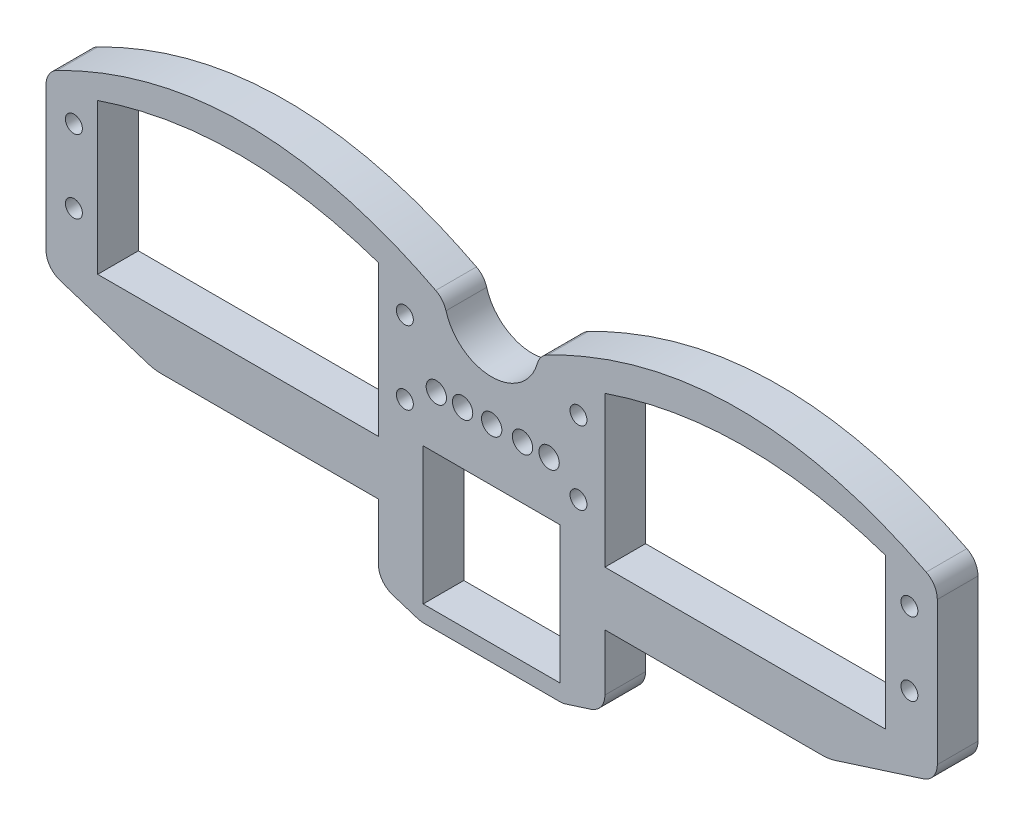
ISO-10303-21;
HEADER;
FILE_DESCRIPTION(('STEP AP214'),'2;1');
FILE_NAME('part.step','',(''),(''),'','','');
FILE_SCHEMA(('AUTOMOTIVE_DESIGN { 1 0 10303 214 1 1 1 1 }'));
ENDSEC;
DATA;
#1=APPLICATION_CONTEXT('core data for automotive mechanical design processes');
#2=APPLICATION_PROTOCOL_DEFINITION('international standard','automotive_design',2000,#1);
#3=PRODUCT_CONTEXT('',#1,'mechanical');
#4=PRODUCT('Part','Part','',(#3));
#5=PRODUCT_RELATED_PRODUCT_CATEGORY('part','',(#4));
#6=PRODUCT_DEFINITION_FORMATION('','',#4);
#7=PRODUCT_DEFINITION_CONTEXT('part definition',#1,'design');
#8=PRODUCT_DEFINITION('design','',#6,#7);
#9=PRODUCT_DEFINITION_SHAPE('','',#8);
#10=(LENGTH_UNIT() NAMED_UNIT(*) SI_UNIT(.MILLI.,.METRE.));
#11=(NAMED_UNIT(*) PLANE_ANGLE_UNIT() SI_UNIT($,.RADIAN.));
#12=(NAMED_UNIT(*) SI_UNIT($,.STERADIAN.) SOLID_ANGLE_UNIT());
#13=UNCERTAINTY_MEASURE_WITH_UNIT(LENGTH_MEASURE(1.E-05),#10,'distance_accuracy_value','');
#14=(GEOMETRIC_REPRESENTATION_CONTEXT(3) GLOBAL_UNCERTAINTY_ASSIGNED_CONTEXT((#13)) GLOBAL_UNIT_ASSIGNED_CONTEXT((#10,
#11,#12)) REPRESENTATION_CONTEXT('',''));
#15=CARTESIAN_POINT('',(0.,0.,0.));
#16=DIRECTION('',(0.,0.,1.));
#17=DIRECTION('',(1.,0.,0.));
#18=AXIS2_PLACEMENT_3D('',#15,#16,#17);
#19=CARTESIAN_POINT('',(-164.630106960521,31.0786567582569,6.));
#20=DIRECTION('',(0.,0.,-1.));
#21=DIRECTION('',(-1.,0.,0.));
#22=AXIS2_PLACEMENT_3D('',#19,#20,#21);
#23=CYLINDRICAL_SURFACE('',#22,2.99999999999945);
#24=CARTESIAN_POINT('',(-164.630106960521,31.0786567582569,0.));
#25=DIRECTION('',(0.,0.,1.));
#26=DIRECTION('',(1.,0.,0.));
#27=AXIS2_PLACEMENT_3D('',#24,#25,#26);
#28=CIRCLE('',#27,2.99999999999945);
#29=CARTESIAN_POINT('',(-161.630106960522,31.0786567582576,0.));
#30=VERTEX_POINT('',#29);
#31=CARTESIAN_POINT('',(-163.272123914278,33.7537048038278,0.));
#32=VERTEX_POINT('',#31);
#33=EDGE_CURVE('E386',#30,#32,#28,.T.);
#34=ORIENTED_EDGE('',*,*,#33,.T.);
#35=DIRECTION('',(0.,0.,-1.));
#36=VECTOR('',#35,1.);
#37=CARTESIAN_POINT('',(-163.272123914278,33.7537048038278,6.));
#38=LINE('',#37,#36);
#39=CARTESIAN_POINT('',(-163.272123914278,33.7537048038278,6.));
#40=VERTEX_POINT('',#39);
#41=EDGE_CURVE('E11',#40,#32,#38,.T.);
#42=ORIENTED_EDGE('',*,*,#41,.F.);
#43=CARTESIAN_POINT('',(-164.630106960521,31.0786567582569,6.));
#44=DIRECTION('',(0.,0.,1.));
#45=DIRECTION('',(1.,0.,0.));
#46=AXIS2_PLACEMENT_3D('',#43,#44,#45);
#47=CIRCLE('',#46,2.99999999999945);
#48=CARTESIAN_POINT('',(-161.630106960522,31.0786567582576,6.));
#49=VERTEX_POINT('',#48);
#50=EDGE_CURVE('E742',#49,#40,#47,.T.);
#51=ORIENTED_EDGE('',*,*,#50,.F.);
#52=DIRECTION('',(0.,0.,-1.));
#53=VECTOR('',#52,1.);
#54=CARTESIAN_POINT('',(-161.630106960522,31.0786567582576,6.));
#55=LINE('',#54,#53);
#56=EDGE_CURVE('E53',#49,#30,#55,.T.);
#57=ORIENTED_EDGE('',*,*,#56,.T.);
#58=EDGE_LOOP('',(#34,#42,#51,#57));
#59=FACE_BOUND('',#58,.T.);
#60=ADVANCED_FACE('F33',(#59),#23,.T.);
#61=CARTESIAN_POINT('',(-163.272123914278,33.7537048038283,6.));
#62=CARTESIAN_POINT('',(-172.45079135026,38.413237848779,6.));
#63=CARTESIAN_POINT('',(-191.073379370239,43.1627304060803,6.));
#64=CARTESIAN_POINT('',(-209.666506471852,38.4121695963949,6.));
#65=CARTESIAN_POINT('',(-219.095969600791,33.5710117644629,6.));
#66=B_SPLINE_CURVE_WITH_KNOTS('',3,(#61,#62,#63,#64,#65),.UNSPECIFIED.,.F.,.F.,(4,1,4),
(0.0279701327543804,0.497008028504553,0.978120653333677),.UNSPECIFIED.);
#67=DIRECTION('',(0.,0.,-1.));
#68=VECTOR('',#67,1.);
#69=SURFACE_OF_LINEAR_EXTRUSION('',#66,#68);
#70=CARTESIAN_POINT('',(-163.272123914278,33.7537048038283,0.));
#71=CARTESIAN_POINT('',(-172.45079135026,38.413237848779,0.));
#72=CARTESIAN_POINT('',(-191.073379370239,43.1627304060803,0.));
#73=CARTESIAN_POINT('',(-209.666506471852,38.4121695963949,0.));
#74=CARTESIAN_POINT('',(-219.095969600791,33.5710117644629,0.));
#75=B_SPLINE_CURVE_WITH_KNOTS('',3,(#70,#71,#72,#73,#74),.UNSPECIFIED.,.F.,.F.,(4,1,4),
(0.0279701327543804,0.497008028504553,0.978120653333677),.UNSPECIFIED.);
#76=CARTESIAN_POINT('',(-219.095969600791,33.5710117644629,0.));
#77=VERTEX_POINT('',#76);
#78=EDGE_CURVE('E388',#32,#77,#75,.T.);
#79=ORIENTED_EDGE('',*,*,#78,.T.);
#80=DIRECTION('',(0.,0.,-1.));
#81=VECTOR('',#80,1.);
#82=CARTESIAN_POINT('',(-219.095969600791,33.5710117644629,6.));
#83=LINE('',#82,#81);
#84=CARTESIAN_POINT('',(-219.095969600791,33.5710117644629,6.));
#85=VERTEX_POINT('',#84);
#86=EDGE_CURVE('E44',#85,#77,#83,.T.);
#87=ORIENTED_EDGE('',*,*,#86,.F.);
#88=EDGE_CURVE('E743',#40,#85,#66,.T.);
#89=ORIENTED_EDGE('',*,*,#88,.F.);
#90=ORIENTED_EDGE('',*,*,#41,.T.);
#91=EDGE_LOOP('',(#79,#87,#89,#90));
#92=FACE_BOUND('',#91,.T.);
#93=ADVANCED_FACE('F630',(#92),#69,.F.);
#94=CARTESIAN_POINT('',(-217.725779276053,30.9021958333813,6.));
#95=DIRECTION('',(0.,0.,-1.));
#96=DIRECTION('',(-1.,0.,0.));
#97=AXIS2_PLACEMENT_3D('',#94,#95,#96);
#98=CYLINDRICAL_SURFACE('',#97,2.99999999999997);
#99=CARTESIAN_POINT('',(-217.725779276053,30.9021958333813,0.));
#100=DIRECTION('',(0.,0.,1.));
#101=DIRECTION('',(1.,0.,0.));
#102=AXIS2_PLACEMENT_3D('',#99,#100,#101);
#103=CIRCLE('',#102,2.99999999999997);
#104=CARTESIAN_POINT('',(-220.610692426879,31.725163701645,0.));
#105=VERTEX_POINT('',#104);
#106=EDGE_CURVE('E393',#105,#77,#103,.F.);
#107=ORIENTED_EDGE('',*,*,#106,.F.);
#108=DIRECTION('',(0.,0.,-1.));
#109=VECTOR('',#108,1.);
#110=CARTESIAN_POINT('',(-220.610692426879,31.725163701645,6.));
#111=LINE('',#110,#109);
#112=CARTESIAN_POINT('',(-220.610692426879,31.725163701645,6.));
#113=VERTEX_POINT('',#112);
#114=EDGE_CURVE('E513',#113,#105,#111,.T.);
#115=ORIENTED_EDGE('',*,*,#114,.F.);
#116=CARTESIAN_POINT('',(-217.725779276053,30.9021958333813,6.));
#117=DIRECTION('',(0.,0.,1.));
#118=DIRECTION('',(1.,0.,0.));
#119=AXIS2_PLACEMENT_3D('',#116,#117,#118);
#120=CIRCLE('',#119,2.99999999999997);
#121=EDGE_CURVE('E748',#113,#85,#120,.F.);
#122=ORIENTED_EDGE('',*,*,#121,.T.);
#123=ORIENTED_EDGE('',*,*,#86,.T.);
#124=EDGE_LOOP('',(#107,#115,#122,#123));
#125=FACE_BOUND('',#124,.T.);
#126=ADVANCED_FACE('F635',(#125),#98,.T.);
#127=CARTESIAN_POINT('',(-227.342156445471,33.6454220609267,6.));
#128=DIRECTION('',(0.,0.,-1.));
#129=DIRECTION('',(-1.,0.,0.));
#130=AXIS2_PLACEMENT_3D('',#127,#128,#129);
#131=CYLINDRICAL_SURFACE('',#130,7.00000000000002);
#132=CARTESIAN_POINT('',(-227.342156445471,33.6454220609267,0.));
#133=DIRECTION('',(0.,0.,1.));
#134=DIRECTION('',(1.,0.,0.));
#135=AXIS2_PLACEMENT_3D('',#132,#133,#134);
#136=CIRCLE('',#135,7.00000000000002);
#137=CARTESIAN_POINT('',(-234.073620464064,31.725163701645,0.));
#138=VERTEX_POINT('',#137);
#139=EDGE_CURVE('E399',#138,#105,#136,.T.);
#140=ORIENTED_EDGE('',*,*,#139,.F.);
#141=DIRECTION('',(0.,0.,-1.));
#142=VECTOR('',#141,1.);
#143=CARTESIAN_POINT('',(-234.073620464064,31.725163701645,6.));
#144=LINE('',#143,#142);
#145=CARTESIAN_POINT('',(-234.073620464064,31.725163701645,6.));
#146=VERTEX_POINT('',#145);
#147=EDGE_CURVE('E511',#146,#138,#144,.T.);
#148=ORIENTED_EDGE('',*,*,#147,.F.);
#149=CARTESIAN_POINT('',(-227.342156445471,33.6454220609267,6.));
#150=DIRECTION('',(0.,0.,1.));
#151=DIRECTION('',(1.,0.,0.));
#152=AXIS2_PLACEMENT_3D('',#149,#150,#151);
#153=CIRCLE('',#152,7.00000000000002);
#154=EDGE_CURVE('E754',#146,#113,#153,.T.);
#155=ORIENTED_EDGE('',*,*,#154,.T.);
#156=ORIENTED_EDGE('',*,*,#114,.T.);
#157=EDGE_LOOP('',(#140,#148,#155,#156));
#158=FACE_BOUND('',#157,.T.);
#159=ADVANCED_FACE('F781',(#158),#131,.F.);
#160=CARTESIAN_POINT('',(-236.95853361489,30.9021958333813,6.));
#161=DIRECTION('',(0.,0.,-1.));
#162=DIRECTION('',(-1.,0.,0.));
#163=AXIS2_PLACEMENT_3D('',#160,#161,#162);
#164=CYLINDRICAL_SURFACE('',#163,3.00000000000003);
#165=CARTESIAN_POINT('',(-236.95853361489,30.9021958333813,0.));
#166=DIRECTION('',(0.,0.,1.));
#167=DIRECTION('',(1.,0.,0.));
#168=AXIS2_PLACEMENT_3D('',#165,#166,#167);
#169=CIRCLE('',#168,3.00000000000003);
#170=CARTESIAN_POINT('',(-235.588343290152,33.5710117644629,0.));
#171=VERTEX_POINT('',#170);
#172=EDGE_CURVE('E402',#138,#171,#169,.T.);
#173=ORIENTED_EDGE('',*,*,#172,.T.);
#174=DIRECTION('',(0.,0.,-1.));
#175=VECTOR('',#174,1.);
#176=CARTESIAN_POINT('',(-235.588343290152,33.5710117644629,6.));
#177=LINE('',#176,#175);
#178=CARTESIAN_POINT('',(-235.588343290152,33.5710117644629,6.));
#179=VERTEX_POINT('',#178);
#180=EDGE_CURVE('E509',#179,#171,#177,.T.);
#181=ORIENTED_EDGE('',*,*,#180,.F.);
#182=CARTESIAN_POINT('',(-236.95853361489,30.9021958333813,6.));
#183=DIRECTION('',(0.,0.,1.));
#184=DIRECTION('',(1.,0.,0.));
#185=AXIS2_PLACEMENT_3D('',#182,#183,#184);
#186=CIRCLE('',#185,3.00000000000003);
#187=EDGE_CURVE('E757',#146,#179,#186,.T.);
#188=ORIENTED_EDGE('',*,*,#187,.F.);
#189=ORIENTED_EDGE('',*,*,#147,.T.);
#190=EDGE_LOOP('',(#173,#181,#188,#189));
#191=FACE_BOUND('',#190,.T.);
#192=ADVANCED_FACE('F776',(#191),#164,.T.);
#193=CARTESIAN_POINT('',(-291.412188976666,33.7537048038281,6.));
#194=CARTESIAN_POINT('',(-282.233521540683,38.4132378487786,6.));
#195=CARTESIAN_POINT('',(-263.610933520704,43.1627304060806,6.));
#196=CARTESIAN_POINT('',(-245.01780641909,38.4121695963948,6.));
#197=CARTESIAN_POINT('',(-235.588343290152,33.5710117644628,6.));
#198=B_SPLINE_CURVE_WITH_KNOTS('',3,(#193,#194,#195,#196,#197),.UNSPECIFIED.,.F.,.F.,(4,1,4),
(0.0279701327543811,0.497008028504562,0.978120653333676),.UNSPECIFIED.);
#199=DIRECTION('',(0.,0.,-1.));
#200=VECTOR('',#199,1.);
#201=SURFACE_OF_LINEAR_EXTRUSION('',#198,#200);
#202=CARTESIAN_POINT('',(-291.412188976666,33.7537048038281,0.));
#203=CARTESIAN_POINT('',(-282.233521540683,38.4132378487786,0.));
#204=CARTESIAN_POINT('',(-263.610933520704,43.1627304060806,0.));
#205=CARTESIAN_POINT('',(-245.01780641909,38.4121695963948,0.));
#206=CARTESIAN_POINT('',(-235.588343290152,33.5710117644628,0.));
#207=B_SPLINE_CURVE_WITH_KNOTS('',3,(#202,#203,#204,#205,#206),.UNSPECIFIED.,.F.,.F.,(4,1,4),
(0.0279701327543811,0.497008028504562,0.978120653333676),.UNSPECIFIED.);
#208=CARTESIAN_POINT('',(-291.412188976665,33.7537048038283,0.));
#209=VERTEX_POINT('',#208);
#210=EDGE_CURVE('E405',#209,#171,#207,.T.);
#211=ORIENTED_EDGE('',*,*,#210,.F.);
#212=DIRECTION('',(0.,0.,-1.));
#213=VECTOR('',#212,1.);
#214=CARTESIAN_POINT('',(-291.412188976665,33.7537048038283,6.));
#215=LINE('',#214,#213);
#216=CARTESIAN_POINT('',(-291.412188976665,33.7537048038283,6.));
#217=VERTEX_POINT('',#216);
#218=EDGE_CURVE('E507',#217,#209,#215,.T.);
#219=ORIENTED_EDGE('',*,*,#218,.F.);
#220=EDGE_CURVE('E759',#217,#179,#198,.T.);
#221=ORIENTED_EDGE('',*,*,#220,.T.);
#222=ORIENTED_EDGE('',*,*,#180,.T.);
#223=EDGE_LOOP('',(#211,#219,#221,#222));
#224=FACE_BOUND('',#223,.T.);
#225=ADVANCED_FACE('F771',(#224),#201,.T.);
#226=CARTESIAN_POINT('',(-290.054205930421,31.0786567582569,6.));
#227=DIRECTION('',(0.,0.,-1.));
#228=DIRECTION('',(-1.,0.,0.));
#229=AXIS2_PLACEMENT_3D('',#226,#227,#228);
#230=CYLINDRICAL_SURFACE('',#229,2.99999999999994);
#231=CARTESIAN_POINT('',(-290.054205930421,31.0786567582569,0.));
#232=DIRECTION('',(0.,0.,1.));
#233=DIRECTION('',(1.,0.,0.));
#234=AXIS2_PLACEMENT_3D('',#231,#232,#233);
#235=CIRCLE('',#234,2.99999999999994);
#236=CARTESIAN_POINT('',(-293.054205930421,31.0786567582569,0.));
#237=VERTEX_POINT('',#236);
#238=EDGE_CURVE('E410',#237,#209,#235,.F.);
#239=ORIENTED_EDGE('',*,*,#238,.F.);
#240=DIRECTION('',(0.,0.,-1.));
#241=VECTOR('',#240,1.);
#242=CARTESIAN_POINT('',(-293.054205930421,31.0786567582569,6.));
#243=LINE('',#242,#241);
#244=CARTESIAN_POINT('',(-293.054205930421,31.0786567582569,6.));
#245=VERTEX_POINT('',#244);
#246=EDGE_CURVE('E505',#245,#237,#243,.T.);
#247=ORIENTED_EDGE('',*,*,#246,.F.);
#248=CARTESIAN_POINT('',(-290.054205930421,31.0786567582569,6.));
#249=DIRECTION('',(0.,0.,1.));
#250=DIRECTION('',(1.,0.,0.));
#251=AXIS2_PLACEMENT_3D('',#248,#249,#250);
#252=CIRCLE('',#251,2.99999999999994);
#253=EDGE_CURVE('E765',#245,#217,#252,.F.);
#254=ORIENTED_EDGE('',*,*,#253,.T.);
#255=ORIENTED_EDGE('',*,*,#218,.T.);
#256=EDGE_LOOP('',(#239,#247,#254,#255));
#257=FACE_BOUND('',#256,.T.);
#258=ADVANCED_FACE('F775',(#257),#230,.T.);
#259=CARTESIAN_POINT('',(-293.054205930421,-93.6736711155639,6.));
#260=DIRECTION('',(1.,0.,0.));
#261=DIRECTION('',(0.,0.,-1.));
#262=AXIS2_PLACEMENT_3D('',#259,#260,#261);
#263=PLANE('',#262);
#264=DIRECTION('',(0.,-1.,0.));
#265=VECTOR('',#264,1.);
#266=CARTESIAN_POINT('',(-293.054205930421,-93.6736711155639,0.));
#267=LINE('',#266,#265);
#268=CARTESIAN_POINT('',(-293.054205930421,9.99100277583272,0.));
#269=VERTEX_POINT('',#268);
#270=EDGE_CURVE('E416',#237,#269,#267,.T.);
#271=ORIENTED_EDGE('',*,*,#270,.T.);
#272=DIRECTION('',(0.,0.,-1.));
#273=VECTOR('',#272,1.);
#274=CARTESIAN_POINT('',(-293.054205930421,9.99100277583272,6.));
#275=LINE('',#274,#273);
#276=CARTESIAN_POINT('',(-293.054205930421,9.99100277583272,6.));
#277=VERTEX_POINT('',#276);
#278=EDGE_CURVE('E503',#277,#269,#275,.T.);
#279=ORIENTED_EDGE('',*,*,#278,.F.);
#280=DIRECTION('',(0.,-1.,0.));
#281=VECTOR('',#280,1.);
#282=CARTESIAN_POINT('',(-293.054205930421,-93.6736711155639,6.));
#283=LINE('',#282,#281);
#284=EDGE_CURVE('E890',#245,#277,#283,.T.);
#285=ORIENTED_EDGE('',*,*,#284,.F.);
#286=ORIENTED_EDGE('',*,*,#246,.T.);
#287=EDGE_LOOP('',(#271,#279,#285,#286));
#288=FACE_BOUND('',#287,.T.);
#289=ADVANCED_FACE('F871',(#288),#263,.F.);
#290=CARTESIAN_POINT('',(-290.054205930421,9.99100277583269,6.));
#291=DIRECTION('',(0.,0.,-1.));
#292=DIRECTION('',(-1.,0.,0.));
#293=AXIS2_PLACEMENT_3D('',#290,#291,#292);
#294=CYLINDRICAL_SURFACE('',#293,3.);
#295=CARTESIAN_POINT('',(-290.054205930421,9.99100277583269,0.));
#296=DIRECTION('',(0.,0.,1.));
#297=DIRECTION('',(1.,0.,0.));
#298=AXIS2_PLACEMENT_3D('',#295,#296,#297);
#299=CIRCLE('',#298,3.);
#300=CARTESIAN_POINT('',(-290.965345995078,7.13271241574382,0.));
#301=VERTEX_POINT('',#300);
#302=EDGE_CURVE('E419',#301,#269,#299,.F.);
#303=ORIENTED_EDGE('',*,*,#302,.F.);
#304=DIRECTION('',(0.,0.,-1.));
#305=VECTOR('',#304,1.);
#306=CARTESIAN_POINT('',(-290.965345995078,7.13271241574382,6.));
#307=LINE('',#306,#305);
#308=CARTESIAN_POINT('',(-290.965345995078,7.13271241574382,6.));
#309=VERTEX_POINT('',#308);
#310=EDGE_CURVE('E501',#309,#301,#307,.T.);
#311=ORIENTED_EDGE('',*,*,#310,.F.);
#312=CARTESIAN_POINT('',(-290.054205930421,9.99100277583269,6.));
#313=DIRECTION('',(0.,0.,1.));
#314=DIRECTION('',(1.,0.,0.));
#315=AXIS2_PLACEMENT_3D('',#312,#313,#314);
#316=CIRCLE('',#315,3.);
#317=EDGE_CURVE('E888',#309,#277,#316,.F.);
#318=ORIENTED_EDGE('',*,*,#317,.T.);
#319=ORIENTED_EDGE('',*,*,#278,.T.);
#320=EDGE_LOOP('',(#303,#311,#318,#319));
#321=FACE_BOUND('',#320,.T.);
#322=ADVANCED_FACE('F868',(#321),#294,.T.);
#323=CARTESIAN_POINT('',(-204.040834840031,-20.576300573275,6.));
#324=DIRECTION('',(0.303713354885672,0.952763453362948,0.));
#325=DIRECTION('',(-0.952763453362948,0.303713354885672,0.));
#326=AXIS2_PLACEMENT_3D('',#323,#324,#325);
#327=PLANE('',#326);
#328=DIRECTION('',(0.952763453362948,-0.303713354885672,0.));
#329=VECTOR('',#328,1.);
#330=CARTESIAN_POINT('',(-204.040834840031,-20.576300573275,0.));
#331=LINE('',#330,#329);
#332=CARTESIAN_POINT('',(-277.944359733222,2.98199965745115,0.));
#333=VERTEX_POINT('',#332);
#334=EDGE_CURVE('E422',#301,#333,#331,.T.);
#335=ORIENTED_EDGE('',*,*,#334,.T.);
#336=DIRECTION('',(0.,0.,-1.));
#337=VECTOR('',#336,1.);
#338=CARTESIAN_POINT('',(-277.944359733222,2.98199965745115,6.));
#339=LINE('',#338,#337);
#340=CARTESIAN_POINT('',(-277.944359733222,2.98199965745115,6.));
#341=VERTEX_POINT('',#340);
#342=EDGE_CURVE('E499',#341,#333,#339,.T.);
#343=ORIENTED_EDGE('',*,*,#342,.F.);
#344=DIRECTION('',(0.952763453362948,-0.303713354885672,0.));
#345=VECTOR('',#344,1.);
#346=CARTESIAN_POINT('',(-204.040834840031,-20.576300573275,6.));
#347=LINE('',#346,#345);
#348=EDGE_CURVE('E889',#309,#341,#347,.T.);
#349=ORIENTED_EDGE('',*,*,#348,.F.);
#350=ORIENTED_EDGE('',*,*,#310,.T.);
#351=EDGE_LOOP('',(#335,#343,#349,#350));
#352=FACE_BOUND('',#351,.T.);
#353=ADVANCED_FACE('F864',(#352),#327,.F.);
#354=CARTESIAN_POINT('',(-276.122079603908,8.69858037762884,6.));
#355=DIRECTION('',(0.,0.,-1.));
#356=DIRECTION('',(-1.,0.,0.));
#357=AXIS2_PLACEMENT_3D('',#354,#355,#356);
#358=CYLINDRICAL_SURFACE('',#357,6.);
#359=CARTESIAN_POINT('',(-276.122079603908,8.69858037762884,0.));
#360=DIRECTION('',(0.,0.,1.));
#361=DIRECTION('',(1.,0.,0.));
#362=AXIS2_PLACEMENT_3D('',#359,#360,#361);
#363=CIRCLE('',#362,6.);
#364=CARTESIAN_POINT('',(-276.122079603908,2.69858037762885,0.));
#365=VERTEX_POINT('',#364);
#366=EDGE_CURVE('E425',#365,#333,#363,.F.);
#367=ORIENTED_EDGE('',*,*,#366,.F.);
#368=DIRECTION('',(0.,0.,-1.));
#369=VECTOR('',#368,1.);
#370=CARTESIAN_POINT('',(-276.122079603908,2.69858037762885,6.));
#371=LINE('',#370,#369);
#372=CARTESIAN_POINT('',(-276.122079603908,2.69858037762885,6.));
#373=VERTEX_POINT('',#372);
#374=EDGE_CURVE('E497',#373,#365,#371,.T.);
#375=ORIENTED_EDGE('',*,*,#374,.F.);
#376=CARTESIAN_POINT('',(-276.122079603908,8.69858037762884,6.));
#377=DIRECTION('',(0.,0.,1.));
#378=DIRECTION('',(1.,0.,0.));
#379=AXIS2_PLACEMENT_3D('',#376,#377,#378);
#380=CIRCLE('',#379,6.);
#381=EDGE_CURVE('E892',#373,#341,#380,.F.);
#382=ORIENTED_EDGE('',*,*,#381,.T.);
#383=ORIENTED_EDGE('',*,*,#342,.T.);
#384=EDGE_LOOP('',(#367,#375,#382,#383));
#385=FACE_BOUND('',#384,.T.);
#386=ADVANCED_FACE('F860',(#385),#358,.T.);
#387=CARTESIAN_POINT('',(-227.342156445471,2.69858037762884,6.));
#388=DIRECTION('',(0.,-1.,0.));
#389=DIRECTION('',(1.,0.,0.));
#390=AXIS2_PLACEMENT_3D('',#387,#388,#389);
#391=PLANE('',#390);
#392=DIRECTION('',(-1.,0.,0.));
#393=VECTOR('',#392,1.);
#394=CARTESIAN_POINT('',(-227.342156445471,2.69858037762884,0.));
#395=LINE('',#394,#393);
#396=CARTESIAN_POINT('',(-244.039056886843,2.69858037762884,0.));
#397=VERTEX_POINT('',#396);
#398=EDGE_CURVE('E428',#397,#365,#395,.T.);
#399=ORIENTED_EDGE('',*,*,#398,.F.);
#400=DIRECTION('',(0.,0.,-1.));
#401=VECTOR('',#400,1.);
#402=CARTESIAN_POINT('',(-244.039056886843,2.69858037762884,6.));
#403=LINE('',#402,#401);
#404=CARTESIAN_POINT('',(-244.039056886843,2.69858037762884,6.));
#405=VERTEX_POINT('',#404);
#406=EDGE_CURVE('E495',#405,#397,#403,.T.);
#407=ORIENTED_EDGE('',*,*,#406,.F.);
#408=DIRECTION('',(-1.,0.,0.));
#409=VECTOR('',#408,1.);
#410=CARTESIAN_POINT('',(-227.342156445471,2.69858037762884,6.));
#411=LINE('',#410,#409);
#412=EDGE_CURVE('E897',#405,#373,#411,.T.);
#413=ORIENTED_EDGE('',*,*,#412,.T.);
#414=ORIENTED_EDGE('',*,*,#374,.T.);
#415=EDGE_LOOP('',(#399,#407,#413,#414));
#416=FACE_BOUND('',#415,.T.);
#417=ADVANCED_FACE('F856',(#416),#391,.T.);
#418=CARTESIAN_POINT('',(-244.039056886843,-93.6736711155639,6.));
#419=DIRECTION('',(-1.,0.,0.));
#420=DIRECTION('',(0.,0.,1.));
#421=AXIS2_PLACEMENT_3D('',#418,#419,#420);
#422=PLANE('',#421);
#423=DIRECTION('',(0.,1.,0.));
#424=VECTOR('',#423,1.);
#425=CARTESIAN_POINT('',(-244.039056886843,-93.6736711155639,0.));
#426=LINE('',#425,#424);
#427=CARTESIAN_POINT('',(-244.039056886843,-5.63360509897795,0.));
#428=VERTEX_POINT('',#427);
#429=EDGE_CURVE('E431',#428,#397,#426,.T.);
#430=ORIENTED_EDGE('',*,*,#429,.F.);
#431=DIRECTION('',(0.,0.,-1.));
#432=VECTOR('',#431,1.);
#433=CARTESIAN_POINT('',(-244.039056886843,-5.63360509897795,6.));
#434=LINE('',#433,#432);
#435=CARTESIAN_POINT('',(-244.039056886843,-5.63360509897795,6.));
#436=VERTEX_POINT('',#435);
#437=EDGE_CURVE('E493',#436,#428,#434,.T.);
#438=ORIENTED_EDGE('',*,*,#437,.F.);
#439=DIRECTION('',(0.,1.,0.));
#440=VECTOR('',#439,1.);
#441=CARTESIAN_POINT('',(-244.039056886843,-93.6736711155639,6.));
#442=LINE('',#441,#440);
#443=EDGE_CURVE('E900',#436,#405,#442,.T.);
#444=ORIENTED_EDGE('',*,*,#443,.T.);
#445=ORIENTED_EDGE('',*,*,#406,.T.);
#446=EDGE_LOOP('',(#430,#438,#444,#445));
#447=FACE_BOUND('',#446,.T.);
#448=ADVANCED_FACE('F852',(#447),#422,.T.);
#449=CARTESIAN_POINT('',(-241.039056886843,-5.63360509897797,6.));
#450=DIRECTION('',(0.,0.,-1.));
#451=DIRECTION('',(-1.,0.,0.));
#452=AXIS2_PLACEMENT_3D('',#449,#450,#451);
#453=CYLINDRICAL_SURFACE('',#452,3.);
#454=CARTESIAN_POINT('',(-241.039056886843,-5.63360509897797,0.));
#455=DIRECTION('',(0.,0.,1.));
#456=DIRECTION('',(1.,0.,0.));
#457=AXIS2_PLACEMENT_3D('',#454,#455,#456);
#458=CIRCLE('',#457,3.);
#459=CARTESIAN_POINT('',(-241.9501969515,-8.49189545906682,0.));
#460=VERTEX_POINT('',#459);
#461=EDGE_CURVE('E434',#460,#428,#458,.F.);
#462=ORIENTED_EDGE('',*,*,#461,.F.);
#463=DIRECTION('',(0.,0.,-1.));
#464=VECTOR('',#463,1.);
#465=CARTESIAN_POINT('',(-241.9501969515,-8.49189545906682,6.));
#466=LINE('',#465,#464);
#467=CARTESIAN_POINT('',(-241.9501969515,-8.49189545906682,6.));
#468=VERTEX_POINT('',#467);
#469=EDGE_CURVE('E491',#468,#460,#466,.T.);
#470=ORIENTED_EDGE('',*,*,#469,.F.);
#471=CARTESIAN_POINT('',(-241.039056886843,-5.63360509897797,6.));
#472=DIRECTION('',(0.,0.,1.));
#473=DIRECTION('',(1.,0.,0.));
#474=AXIS2_PLACEMENT_3D('',#471,#472,#473);
#475=CIRCLE('',#474,3.);
#476=EDGE_CURVE('E903',#468,#436,#475,.F.);
#477=ORIENTED_EDGE('',*,*,#476,.T.);
#478=ORIENTED_EDGE('',*,*,#437,.T.);
#479=EDGE_LOOP('',(#462,#470,#477,#478));
#480=FACE_BOUND('',#479,.T.);
#481=ADVANCED_FACE('F848',(#480),#453,.T.);
#482=CARTESIAN_POINT('',(-204.040834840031,-20.5763005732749,6.));
#483=DIRECTION('',(0.303713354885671,0.952763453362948,0.));
#484=DIRECTION('',(-0.952763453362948,0.303713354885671,0.));
#485=AXIS2_PLACEMENT_3D('',#482,#483,#484);
#486=PLANE('',#485);
#487=DIRECTION('',(0.952763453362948,-0.303713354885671,0.));
#488=VECTOR('',#487,1.);
#489=CARTESIAN_POINT('',(-204.040834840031,-20.5763005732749,0.));
#490=LINE('',#489,#488);
#491=CARTESIAN_POINT('',(-238.286706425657,-9.65970998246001,0.));
#492=VERTEX_POINT('',#491);
#493=EDGE_CURVE('E437',#460,#492,#490,.T.);
#494=ORIENTED_EDGE('',*,*,#493,.T.);
#495=DIRECTION('',(0.,0.,-1.));
#496=VECTOR('',#495,1.);
#497=CARTESIAN_POINT('',(-238.286706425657,-9.65970998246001,6.));
#498=LINE('',#497,#496);
#499=CARTESIAN_POINT('',(-238.286706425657,-9.65970998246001,6.));
#500=VERTEX_POINT('',#499);
#501=EDGE_CURVE('E488',#500,#492,#498,.T.);
#502=ORIENTED_EDGE('',*,*,#501,.F.);
#503=DIRECTION('',(0.952763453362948,-0.303713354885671,0.));
#504=VECTOR('',#503,1.);
#505=CARTESIAN_POINT('',(-204.040834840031,-20.5763005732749,6.));
#506=LINE('',#505,#504);
#507=EDGE_CURVE('E906',#468,#500,#506,.T.);
#508=ORIENTED_EDGE('',*,*,#507,.F.);
#509=ORIENTED_EDGE('',*,*,#469,.T.);
#510=EDGE_LOOP('',(#494,#502,#508,#509));
#511=FACE_BOUND('',#510,.T.);
#512=ADVANCED_FACE('F844',(#511),#486,.F.);
#513=CARTESIAN_POINT('',(-237.375566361,-6.80141962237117,6.));
#514=DIRECTION('',(0.,0.,-1.));
#515=DIRECTION('',(-1.,0.,0.));
#516=AXIS2_PLACEMENT_3D('',#513,#514,#515);
#517=CYLINDRICAL_SURFACE('',#516,3.);
#518=CARTESIAN_POINT('',(-237.375566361,-6.80141962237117,0.));
#519=DIRECTION('',(0.,0.,1.));
#520=DIRECTION('',(1.,0.,0.));
#521=AXIS2_PLACEMENT_3D('',#518,#519,#520);
#522=CIRCLE('',#521,3.);
#523=CARTESIAN_POINT('',(-237.375566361,-9.80141962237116,0.));
#524=VERTEX_POINT('',#523);
#525=EDGE_CURVE('E439',#492,#524,#522,.T.);
#526=ORIENTED_EDGE('',*,*,#525,.T.);
#527=DIRECTION('',(0.,0.,-1.));
#528=VECTOR('',#527,1.);
#529=CARTESIAN_POINT('',(-237.375566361,-9.80141962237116,6.));
#530=LINE('',#529,#528);
#531=CARTESIAN_POINT('',(-237.375566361,-9.80141962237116,6.));
#532=VERTEX_POINT('',#531);
#533=EDGE_CURVE('E485',#532,#524,#530,.T.);
#534=ORIENTED_EDGE('',*,*,#533,.F.);
#535=CARTESIAN_POINT('',(-237.375566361,-6.80141962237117,6.));
#536=DIRECTION('',(0.,0.,1.));
#537=DIRECTION('',(1.,0.,0.));
#538=AXIS2_PLACEMENT_3D('',#535,#536,#537);
#539=CIRCLE('',#538,3.);
#540=EDGE_CURVE('E908',#500,#532,#539,.T.);
#541=ORIENTED_EDGE('',*,*,#540,.F.);
#542=ORIENTED_EDGE('',*,*,#501,.T.);
#543=EDGE_LOOP('',(#526,#534,#541,#542));
#544=FACE_BOUND('',#543,.T.);
#545=ADVANCED_FACE('F840',(#544),#517,.T.);
#546=CARTESIAN_POINT('',(-227.342156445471,-9.80141962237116,6.));
#547=DIRECTION('',(0.,1.,0.));
#548=DIRECTION('',(0.,0.,1.));
#549=AXIS2_PLACEMENT_3D('',#546,#547,#548);
#550=PLANE('',#549);
#551=DIRECTION('',(1.,0.,0.));
#552=VECTOR('',#551,1.);
#553=CARTESIAN_POINT('',(-227.342156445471,-9.80141962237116,0.));
#554=LINE('',#553,#552);
#555=CARTESIAN_POINT('',(-217.308746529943,-9.80141962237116,0.));
#556=VERTEX_POINT('',#555);
#557=EDGE_CURVE('E441',#524,#556,#554,.T.);
#558=ORIENTED_EDGE('',*,*,#557,.T.);
#559=DIRECTION('',(0.,0.,-1.));
#560=VECTOR('',#559,1.);
#561=CARTESIAN_POINT('',(-217.308746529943,-9.80141962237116,6.));
#562=LINE('',#561,#560);
#563=CARTESIAN_POINT('',(-217.308746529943,-9.80141962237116,6.));
#564=VERTEX_POINT('',#563);
#565=EDGE_CURVE('E482',#564,#556,#562,.T.);
#566=ORIENTED_EDGE('',*,*,#565,.F.);
#567=DIRECTION('',(1.,0.,0.));
#568=VECTOR('',#567,1.);
#569=CARTESIAN_POINT('',(-227.342156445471,-9.80141962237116,6.));
#570=LINE('',#569,#568);
#571=EDGE_CURVE('E910',#532,#564,#570,.T.);
#572=ORIENTED_EDGE('',*,*,#571,.F.);
#573=ORIENTED_EDGE('',*,*,#533,.T.);
#574=EDGE_LOOP('',(#558,#566,#572,#573));
#575=FACE_BOUND('',#574,.T.);
#576=ADVANCED_FACE('F836',(#575),#550,.F.);
#577=CARTESIAN_POINT('',(-217.308746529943,-6.80141962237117,6.));
#578=DIRECTION('',(0.,0.,-1.));
#579=DIRECTION('',(-1.,0.,0.));
#580=AXIS2_PLACEMENT_3D('',#577,#578,#579);
#581=CYLINDRICAL_SURFACE('',#580,3.);
#582=CARTESIAN_POINT('',(-217.308746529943,-6.80141962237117,0.));
#583=DIRECTION('',(0.,0.,1.));
#584=DIRECTION('',(1.,0.,0.));
#585=AXIS2_PLACEMENT_3D('',#582,#583,#584);
#586=CIRCLE('',#585,3.);
#587=CARTESIAN_POINT('',(-216.397606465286,-9.65970998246,0.));
#588=VERTEX_POINT('',#587);
#589=EDGE_CURVE('E443',#556,#588,#586,.T.);
#590=ORIENTED_EDGE('',*,*,#589,.T.);
#591=DIRECTION('',(0.,0.,-1.));
#592=VECTOR('',#591,1.);
#593=CARTESIAN_POINT('',(-216.397606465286,-9.65970998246,6.));
#594=LINE('',#593,#592);
#595=CARTESIAN_POINT('',(-216.397606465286,-9.65970998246,6.));
#596=VERTEX_POINT('',#595);
#597=EDGE_CURVE('E480',#596,#588,#594,.T.);
#598=ORIENTED_EDGE('',*,*,#597,.F.);
#599=CARTESIAN_POINT('',(-217.308746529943,-6.80141962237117,6.));
#600=DIRECTION('',(0.,0.,1.));
#601=DIRECTION('',(1.,0.,0.));
#602=AXIS2_PLACEMENT_3D('',#599,#600,#601);
#603=CIRCLE('',#602,3.);
#604=EDGE_CURVE('E912',#564,#596,#603,.T.);
#605=ORIENTED_EDGE('',*,*,#604,.F.);
#606=ORIENTED_EDGE('',*,*,#565,.T.);
#607=EDGE_LOOP('',(#590,#598,#605,#606));
#608=FACE_BOUND('',#607,.T.);
#609=ADVANCED_FACE('F832',(#608),#581,.T.);
#610=CARTESIAN_POINT('',(-250.643478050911,-20.5763005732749,6.));
#611=DIRECTION('',(0.303713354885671,-0.952763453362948,0.));
#612=DIRECTION('',(0.952763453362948,0.303713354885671,0.));
#613=AXIS2_PLACEMENT_3D('',#610,#611,#612);
#614=PLANE('',#613);
#615=DIRECTION('',(-0.952763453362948,-0.303713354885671,0.));
#616=VECTOR('',#615,1.);
#617=CARTESIAN_POINT('',(-250.643478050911,-20.5763005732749,0.));
#618=LINE('',#617,#616);
#619=CARTESIAN_POINT('',(-212.734115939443,-8.49189545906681,0.));
#620=VERTEX_POINT('',#619);
#621=EDGE_CURVE('E446',#620,#588,#618,.T.);
#622=ORIENTED_EDGE('',*,*,#621,.F.);
#623=DIRECTION('',(0.,0.,-1.));
#624=VECTOR('',#623,1.);
#625=CARTESIAN_POINT('',(-212.734115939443,-8.49189545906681,6.));
#626=LINE('',#625,#624);
#627=CARTESIAN_POINT('',(-212.734115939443,-8.49189545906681,6.));
#628=VERTEX_POINT('',#627);
#629=EDGE_CURVE('E478',#628,#620,#626,.T.);
#630=ORIENTED_EDGE('',*,*,#629,.F.);
#631=DIRECTION('',(-0.952763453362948,-0.303713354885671,0.));
#632=VECTOR('',#631,1.);
#633=CARTESIAN_POINT('',(-250.643478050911,-20.5763005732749,6.));
#634=LINE('',#633,#632);
#635=EDGE_CURVE('E914',#628,#596,#634,.T.);
#636=ORIENTED_EDGE('',*,*,#635,.T.);
#637=ORIENTED_EDGE('',*,*,#597,.T.);
#638=EDGE_LOOP('',(#622,#630,#636,#637));
#639=FACE_BOUND('',#638,.T.);
#640=ADVANCED_FACE('F828',(#639),#614,.T.);
#641=CARTESIAN_POINT('',(-213.6452560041,-5.63360509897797,6.));
#642=DIRECTION('',(0.,0.,-1.));
#643=DIRECTION('',(-1.,0.,0.));
#644=AXIS2_PLACEMENT_3D('',#641,#642,#643);
#645=CYLINDRICAL_SURFACE('',#644,3.);
#646=CARTESIAN_POINT('',(-213.6452560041,-5.63360509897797,0.));
#647=DIRECTION('',(0.,0.,1.));
#648=DIRECTION('',(1.,0.,0.));
#649=AXIS2_PLACEMENT_3D('',#646,#647,#648);
#650=CIRCLE('',#649,3.);
#651=CARTESIAN_POINT('',(-210.6452560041,-5.63360509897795,0.));
#652=VERTEX_POINT('',#651);
#653=EDGE_CURVE('E449',#652,#620,#650,.F.);
#654=ORIENTED_EDGE('',*,*,#653,.F.);
#655=DIRECTION('',(0.,0.,-1.));
#656=VECTOR('',#655,1.);
#657=CARTESIAN_POINT('',(-210.6452560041,-5.63360509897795,6.));
#658=LINE('',#657,#656);
#659=CARTESIAN_POINT('',(-210.6452560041,-5.63360509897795,6.));
#660=VERTEX_POINT('',#659);
#661=EDGE_CURVE('E476',#660,#652,#658,.T.);
#662=ORIENTED_EDGE('',*,*,#661,.F.);
#663=CARTESIAN_POINT('',(-213.6452560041,-5.63360509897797,6.));
#664=DIRECTION('',(0.,0.,1.));
#665=DIRECTION('',(1.,0.,0.));
#666=AXIS2_PLACEMENT_3D('',#663,#664,#665);
#667=CIRCLE('',#666,3.);
#668=EDGE_CURVE('E917',#660,#628,#667,.F.);
#669=ORIENTED_EDGE('',*,*,#668,.T.);
#670=ORIENTED_EDGE('',*,*,#629,.T.);
#671=EDGE_LOOP('',(#654,#662,#669,#670));
#672=FACE_BOUND('',#671,.T.);
#673=ADVANCED_FACE('F824',(#672),#645,.T.);
#674=CARTESIAN_POINT('',(-210.6452560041,-93.6736711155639,6.));
#675=DIRECTION('',(-1.,0.,0.));
#676=DIRECTION('',(0.,0.,1.));
#677=AXIS2_PLACEMENT_3D('',#674,#675,#676);
#678=PLANE('',#677);
#679=DIRECTION('',(0.,1.,0.));
#680=VECTOR('',#679,1.);
#681=CARTESIAN_POINT('',(-210.6452560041,-93.6736711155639,0.));
#682=LINE('',#681,#680);
#683=CARTESIAN_POINT('',(-210.6452560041,2.69858037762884,0.));
#684=VERTEX_POINT('',#683);
#685=EDGE_CURVE('E452',#652,#684,#682,.T.);
#686=ORIENTED_EDGE('',*,*,#685,.T.);
#687=DIRECTION('',(0.,0.,-1.));
#688=VECTOR('',#687,1.);
#689=CARTESIAN_POINT('',(-210.6452560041,2.69858037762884,6.));
#690=LINE('',#689,#688);
#691=CARTESIAN_POINT('',(-210.6452560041,2.69858037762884,6.));
#692=VERTEX_POINT('',#691);
#693=EDGE_CURVE('E473',#692,#684,#690,.T.);
#694=ORIENTED_EDGE('',*,*,#693,.F.);
#695=DIRECTION('',(0.,1.,0.));
#696=VECTOR('',#695,1.);
#697=CARTESIAN_POINT('',(-210.6452560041,-93.6736711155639,6.));
#698=LINE('',#697,#696);
#699=EDGE_CURVE('E920',#660,#692,#698,.T.);
#700=ORIENTED_EDGE('',*,*,#699,.F.);
#701=ORIENTED_EDGE('',*,*,#661,.T.);
#702=EDGE_LOOP('',(#686,#694,#700,#701));
#703=FACE_BOUND('',#702,.T.);
#704=ADVANCED_FACE('F820',(#703),#678,.F.);
#705=CARTESIAN_POINT('',(-227.342156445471,2.69858037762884,6.));
#706=DIRECTION('',(0.,1.,0.));
#707=DIRECTION('',(-1.,0.,0.));
#708=AXIS2_PLACEMENT_3D('',#705,#706,#707);
#709=PLANE('',#708);
#710=DIRECTION('',(1.,0.,0.));
#711=VECTOR('',#710,1.);
#712=CARTESIAN_POINT('',(-227.342156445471,2.69858037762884,0.));
#713=LINE('',#712,#711);
#714=CARTESIAN_POINT('',(-178.562233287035,2.69858037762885,0.));
#715=VERTEX_POINT('',#714);
#716=EDGE_CURVE('E454',#684,#715,#713,.T.);
#717=ORIENTED_EDGE('',*,*,#716,.T.);
#718=DIRECTION('',(0.,0.,-1.));
#719=VECTOR('',#718,1.);
#720=CARTESIAN_POINT('',(-178.562233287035,2.69858037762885,6.));
#721=LINE('',#720,#719);
#722=CARTESIAN_POINT('',(-178.562233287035,2.69858037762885,6.));
#723=VERTEX_POINT('',#722);
#724=EDGE_CURVE('E471',#723,#715,#721,.T.);
#725=ORIENTED_EDGE('',*,*,#724,.F.);
#726=DIRECTION('',(1.,0.,0.));
#727=VECTOR('',#726,1.);
#728=CARTESIAN_POINT('',(-227.342156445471,2.69858037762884,6.));
#729=LINE('',#728,#727);
#730=EDGE_CURVE('E312',#692,#723,#729,.T.);
#731=ORIENTED_EDGE('',*,*,#730,.F.);
#732=ORIENTED_EDGE('',*,*,#693,.T.);
#733=EDGE_LOOP('',(#717,#725,#731,#732));
#734=FACE_BOUND('',#733,.T.);
#735=ADVANCED_FACE('F816',(#734),#709,.F.);
#736=CARTESIAN_POINT('',(-178.562233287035,8.69858037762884,6.));
#737=DIRECTION('',(0.,0.,-1.));
#738=DIRECTION('',(-1.,0.,0.));
#739=AXIS2_PLACEMENT_3D('',#736,#737,#738);
#740=CYLINDRICAL_SURFACE('',#739,6.);
#741=CARTESIAN_POINT('',(-178.562233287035,8.69858037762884,0.));
#742=DIRECTION('',(0.,0.,1.));
#743=DIRECTION('',(1.,0.,0.));
#744=AXIS2_PLACEMENT_3D('',#741,#742,#743);
#745=CIRCLE('',#744,6.);
#746=CARTESIAN_POINT('',(-176.739953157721,2.98199965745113,0.));
#747=VERTEX_POINT('',#746);
#748=EDGE_CURVE('E457',#747,#715,#745,.F.);
#749=ORIENTED_EDGE('',*,*,#748,.F.);
#750=DIRECTION('',(0.,0.,-1.));
#751=VECTOR('',#750,1.);
#752=CARTESIAN_POINT('',(-176.739953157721,2.98199965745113,6.));
#753=LINE('',#752,#751);
#754=CARTESIAN_POINT('',(-176.739953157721,2.98199965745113,6.));
#755=VERTEX_POINT('',#754);
#756=EDGE_CURVE('E298',#755,#747,#753,.T.);
#757=ORIENTED_EDGE('',*,*,#756,.F.);
#758=CARTESIAN_POINT('',(-178.562233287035,8.69858037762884,6.));
#759=DIRECTION('',(0.,0.,1.));
#760=DIRECTION('',(1.,0.,0.));
#761=AXIS2_PLACEMENT_3D('',#758,#759,#760);
#762=CIRCLE('',#761,6.);
#763=EDGE_CURVE('E310',#755,#723,#762,.F.);
#764=ORIENTED_EDGE('',*,*,#763,.T.);
#765=ORIENTED_EDGE('',*,*,#724,.T.);
#766=EDGE_LOOP('',(#749,#757,#764,#765));
#767=FACE_BOUND('',#766,.T.);
#768=ADVANCED_FACE('F813',(#767),#740,.T.);
#769=CARTESIAN_POINT('',(-250.643478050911,-20.576300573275,6.));
#770=DIRECTION('',(0.303713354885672,-0.952763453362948,0.));
#771=DIRECTION('',(0.952763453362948,0.303713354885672,0.));
#772=AXIS2_PLACEMENT_3D('',#769,#770,#771);
#773=PLANE('',#772);
#774=DIRECTION('',(-0.952763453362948,-0.303713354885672,0.));
#775=VECTOR('',#774,1.);
#776=CARTESIAN_POINT('',(-250.643478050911,-20.576300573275,0.));
#777=LINE('',#776,#775);
#778=CARTESIAN_POINT('',(-163.718966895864,7.13271241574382,0.));
#779=VERTEX_POINT('',#778);
#780=EDGE_CURVE('E295',#779,#747,#777,.T.);
#781=ORIENTED_EDGE('',*,*,#780,.F.);
#782=DIRECTION('',(0.,0.,-1.));
#783=VECTOR('',#782,1.);
#784=CARTESIAN_POINT('',(-163.718966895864,7.13271241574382,6.));
#785=LINE('',#784,#783);
#786=CARTESIAN_POINT('',(-163.718966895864,7.13271241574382,6.));
#787=VERTEX_POINT('',#786);
#788=EDGE_CURVE('E289',#787,#779,#785,.T.);
#789=ORIENTED_EDGE('',*,*,#788,.F.);
#790=DIRECTION('',(-0.952763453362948,-0.303713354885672,0.));
#791=VECTOR('',#790,1.);
#792=CARTESIAN_POINT('',(-250.643478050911,-20.576300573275,6.));
#793=LINE('',#792,#791);
#794=EDGE_CURVE('E293',#787,#755,#793,.T.);
#795=ORIENTED_EDGE('',*,*,#794,.T.);
#796=ORIENTED_EDGE('',*,*,#756,.T.);
#797=EDGE_LOOP('',(#781,#789,#795,#796));
#798=FACE_BOUND('',#797,.T.);
#799=ADVANCED_FACE('F291',(#798),#773,.T.);
#800=CARTESIAN_POINT('',(-164.630106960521,9.99100277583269,6.));
#801=DIRECTION('',(0.,0.,-1.));
#802=DIRECTION('',(-1.,0.,0.));
#803=AXIS2_PLACEMENT_3D('',#800,#801,#802);
#804=CYLINDRICAL_SURFACE('',#803,3.);
#805=CARTESIAN_POINT('',(-164.630106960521,9.99100277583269,0.));
#806=DIRECTION('',(0.,0.,1.));
#807=DIRECTION('',(1.,0.,0.));
#808=AXIS2_PLACEMENT_3D('',#805,#806,#807);
#809=CIRCLE('',#808,3.);
#810=CARTESIAN_POINT('',(-161.630106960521,9.99100277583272,0.));
#811=VERTEX_POINT('',#810);
#812=EDGE_CURVE('E461',#779,#811,#809,.T.);
#813=ORIENTED_EDGE('',*,*,#812,.T.);
#814=DIRECTION('',(0.,0.,-1.));
#815=VECTOR('',#814,1.);
#816=CARTESIAN_POINT('',(-161.630106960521,9.99100277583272,6.));
#817=LINE('',#816,#815);
#818=CARTESIAN_POINT('',(-161.630106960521,9.99100277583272,6.));
#819=VERTEX_POINT('',#818);
#820=EDGE_CURVE('E170',#819,#811,#817,.T.);
#821=ORIENTED_EDGE('',*,*,#820,.F.);
#822=CARTESIAN_POINT('',(-164.630106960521,9.99100277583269,6.));
#823=DIRECTION('',(0.,0.,1.));
#824=DIRECTION('',(1.,0.,0.));
#825=AXIS2_PLACEMENT_3D('',#822,#823,#824);
#826=CIRCLE('',#825,3.);
#827=EDGE_CURVE('E300',#787,#819,#826,.T.);
#828=ORIENTED_EDGE('',*,*,#827,.F.);
#829=ORIENTED_EDGE('',*,*,#788,.T.);
#830=EDGE_LOOP('',(#813,#821,#828,#829));
#831=FACE_BOUND('',#830,.T.);
#832=ADVANCED_FACE('F301',(#831),#804,.T.);
#833=CARTESIAN_POINT('',(-227.342156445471,-7.40141962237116,6.));
#834=DIRECTION('',(0.,-1.,0.));
#835=DIRECTION('',(1.,0.,0.));
#836=AXIS2_PLACEMENT_3D('',#833,#834,#835);
#837=PLANE('',#836);
#838=DIRECTION('',(-1.,0.,0.));
#839=VECTOR('',#838,1.);
#840=CARTESIAN_POINT('',(-227.342156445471,-7.40141962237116,0.));
#841=LINE('',#840,#839);
#842=CARTESIAN_POINT('',(-217.242156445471,-7.40141962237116,0.));
#843=VERTEX_POINT('',#842);
#844=CARTESIAN_POINT('',(-237.442156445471,-7.40141962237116,0.));
#845=VERTEX_POINT('',#844);
#846=EDGE_CURVE('E374',#843,#845,#841,.T.);
#847=ORIENTED_EDGE('',*,*,#846,.T.);
#848=DIRECTION('',(0.,0.,-1.));
#849=VECTOR('',#848,1.);
#850=CARTESIAN_POINT('',(-237.442156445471,-7.40141962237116,6.));
#851=LINE('',#850,#849);
#852=CARTESIAN_POINT('',(-237.442156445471,-7.40141962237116,6.));
#853=VERTEX_POINT('',#852);
#854=EDGE_CURVE('E468',#853,#845,#851,.T.);
#855=ORIENTED_EDGE('',*,*,#854,.F.);
#856=DIRECTION('',(-1.,0.,0.));
#857=VECTOR('',#856,1.);
#858=CARTESIAN_POINT('',(-227.342156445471,-7.40141962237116,6.));
#859=LINE('',#858,#857);
#860=CARTESIAN_POINT('',(-217.242156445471,-7.40141962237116,6.));
#861=VERTEX_POINT('',#860);
#862=EDGE_CURVE('E731',#861,#853,#859,.T.);
#863=ORIENTED_EDGE('',*,*,#862,.F.);
#864=DIRECTION('',(0.,0.,-1.));
#865=VECTOR('',#864,1.);
#866=CARTESIAN_POINT('',(-217.242156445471,-7.40141962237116,6.));
#867=LINE('',#866,#865);
#868=EDGE_CURVE('E516',#861,#843,#867,.T.);
#869=ORIENTED_EDGE('',*,*,#868,.T.);
#870=EDGE_LOOP('',(#847,#855,#863,#869));
#871=FACE_BOUND('',#870,.T.);
#872=ADVANCED_FACE('F651',(#871),#837,.F.);
#873=CARTESIAN_POINT('',(-237.442156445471,-93.6736711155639,6.));
#874=DIRECTION('',(-1.,0.,0.));
#875=DIRECTION('',(0.,0.,1.));
#876=AXIS2_PLACEMENT_3D('',#873,#874,#875);
#877=PLANE('',#876);
#878=DIRECTION('',(0.,1.,0.));
#879=VECTOR('',#878,1.);
#880=CARTESIAN_POINT('',(-237.442156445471,-93.6736711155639,0.));
#881=LINE('',#880,#879);
#882=CARTESIAN_POINT('',(-237.442156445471,12.7985803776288,0.));
#883=VERTEX_POINT('',#882);
#884=EDGE_CURVE('E377',#845,#883,#881,.T.);
#885=ORIENTED_EDGE('',*,*,#884,.T.);
#886=DIRECTION('',(0.,0.,-1.));
#887=VECTOR('',#886,1.);
#888=CARTESIAN_POINT('',(-237.442156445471,12.7985803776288,6.));
#889=LINE('',#888,#887);
#890=CARTESIAN_POINT('',(-237.442156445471,12.7985803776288,6.));
#891=VERTEX_POINT('',#890);
#892=EDGE_CURVE('E521',#891,#883,#889,.T.);
#893=ORIENTED_EDGE('',*,*,#892,.F.);
#894=DIRECTION('',(0.,1.,0.));
#895=VECTOR('',#894,1.);
#896=CARTESIAN_POINT('',(-237.442156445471,-93.6736711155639,6.));
#897=LINE('',#896,#895);
#898=EDGE_CURVE('E734',#853,#891,#897,.T.);
#899=ORIENTED_EDGE('',*,*,#898,.F.);
#900=ORIENTED_EDGE('',*,*,#854,.T.);
#901=EDGE_LOOP('',(#885,#893,#899,#900));
#902=FACE_BOUND('',#901,.T.);
#903=ADVANCED_FACE('F647',(#902),#877,.F.);
#904=CARTESIAN_POINT('',(-227.342156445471,12.7985803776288,6.));
#905=DIRECTION('',(0.,-1.,0.));
#906=DIRECTION('',(1.,0.,0.));
#907=AXIS2_PLACEMENT_3D('',#904,#905,#906);
#908=PLANE('',#907);
#909=DIRECTION('',(-1.,0.,0.));
#910=VECTOR('',#909,1.);
#911=CARTESIAN_POINT('',(-227.342156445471,12.7985803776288,0.));
#912=LINE('',#911,#910);
#913=CARTESIAN_POINT('',(-217.242156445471,12.7985803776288,0.));
#914=VERTEX_POINT('',#913);
#915=EDGE_CURVE('E380',#914,#883,#912,.T.);
#916=ORIENTED_EDGE('',*,*,#915,.F.);
#917=DIRECTION('',(0.,0.,-1.));
#918=VECTOR('',#917,1.);
#919=CARTESIAN_POINT('',(-217.242156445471,12.7985803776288,6.));
#920=LINE('',#919,#918);
#921=CARTESIAN_POINT('',(-217.242156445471,12.7985803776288,6.));
#922=VERTEX_POINT('',#921);
#923=EDGE_CURVE('E518',#922,#914,#920,.T.);
#924=ORIENTED_EDGE('',*,*,#923,.F.);
#925=DIRECTION('',(-1.,0.,0.));
#926=VECTOR('',#925,1.);
#927=CARTESIAN_POINT('',(-227.342156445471,12.7985803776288,6.));
#928=LINE('',#927,#926);
#929=EDGE_CURVE('E736',#922,#891,#928,.T.);
#930=ORIENTED_EDGE('',*,*,#929,.T.);
#931=ORIENTED_EDGE('',*,*,#892,.T.);
#932=EDGE_LOOP('',(#916,#924,#930,#931));
#933=FACE_BOUND('',#932,.T.);
#934=ADVANCED_FACE('F610',(#933),#908,.T.);
#935=CARTESIAN_POINT('',(-210.6452560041,-93.6736711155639,6.));
#936=DIRECTION('',(-1.,0.,0.));
#937=DIRECTION('',(0.,0.,1.));
#938=AXIS2_PLACEMENT_3D('',#935,#936,#937);
#939=PLANE('',#938);
#940=DIRECTION('',(0.,1.,0.));
#941=VECTOR('',#940,1.);
#942=CARTESIAN_POINT('',(-210.6452560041,-93.6736711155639,0.));
#943=LINE('',#942,#941);
#944=CARTESIAN_POINT('',(-210.6452560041,10.6985803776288,0.));
#945=VERTEX_POINT('',#944);
#946=CARTESIAN_POINT('',(-210.6452560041,32.8954220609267,0.));
#947=VERTEX_POINT('',#946);
#948=EDGE_CURVE('E336',#945,#947,#943,.T.);
#949=ORIENTED_EDGE('',*,*,#948,.T.);
#950=DIRECTION('',(0.,0.,-1.));
#951=VECTOR('',#950,1.);
#952=CARTESIAN_POINT('',(-210.6452560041,32.8954220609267,6.));
#953=LINE('',#952,#951);
#954=CARTESIAN_POINT('',(-210.6452560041,32.8954220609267,6.));
#955=VERTEX_POINT('',#954);
#956=EDGE_CURVE('E519',#955,#947,#953,.T.);
#957=ORIENTED_EDGE('',*,*,#956,.F.);
#958=DIRECTION('',(0.,1.,0.));
#959=VECTOR('',#958,1.);
#960=CARTESIAN_POINT('',(-210.6452560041,-93.6736711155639,6.));
#961=LINE('',#960,#959);
#962=CARTESIAN_POINT('',(-210.6452560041,10.6985803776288,6.));
#963=VERTEX_POINT('',#962);
#964=EDGE_CURVE('E586',#963,#955,#961,.T.);
#965=ORIENTED_EDGE('',*,*,#964,.F.);
#966=DIRECTION('',(0.,0.,-1.));
#967=VECTOR('',#966,1.);
#968=CARTESIAN_POINT('',(-210.6452560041,10.6985803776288,6.));
#969=LINE('',#968,#967);
#970=EDGE_CURVE('E525',#963,#945,#969,.T.);
#971=ORIENTED_EDGE('',*,*,#970,.T.);
#972=EDGE_LOOP('',(#949,#957,#965,#971));
#973=FACE_BOUND('',#972,.T.);
#974=ADVANCED_FACE('F605',(#973),#939,.F.);
#975=CARTESIAN_POINT('',(-210.6452560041,32.8954220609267,6.));
#976=CARTESIAN_POINT('',(-189.998121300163,39.9474124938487,6.));
#977=CARTESIAN_POINT('',(-169.251567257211,32.8954220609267,6.));
#978=B_SPLINE_CURVE_WITH_KNOTS('',2,(#975,#976,#977),.UNSPECIFIED.,.F.,.F.,(3,3),(0.,1.),.UNSPECIFIED.);
#979=DIRECTION('',(0.,0.,-1.));
#980=VECTOR('',#979,1.);
#981=SURFACE_OF_LINEAR_EXTRUSION('',#978,#980);
#982=CARTESIAN_POINT('',(-210.6452560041,32.8954220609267,0.));
#983=CARTESIAN_POINT('',(-189.998121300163,39.9474124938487,0.));
#984=CARTESIAN_POINT('',(-169.251567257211,32.8954220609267,0.));
#985=B_SPLINE_CURVE_WITH_KNOTS('',2,(#982,#983,#984),.UNSPECIFIED.,.F.,.F.,(3,3),(0.,1.),.UNSPECIFIED.);
#986=CARTESIAN_POINT('',(-169.251567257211,32.8954220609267,0.));
#987=VERTEX_POINT('',#986);
#988=EDGE_CURVE('E339',#947,#987,#985,.T.);
#989=ORIENTED_EDGE('',*,*,#988,.T.);
#990=DIRECTION('',(0.,0.,-1.));
#991=VECTOR('',#990,1.);
#992=CARTESIAN_POINT('',(-169.251567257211,32.8954220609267,6.));
#993=LINE('',#992,#991);
#994=CARTESIAN_POINT('',(-169.251567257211,32.8954220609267,6.));
#995=VERTEX_POINT('',#994);
#996=EDGE_CURVE('E531',#995,#987,#993,.T.);
#997=ORIENTED_EDGE('',*,*,#996,.F.);
#998=EDGE_CURVE('E589',#955,#995,#978,.T.);
#999=ORIENTED_EDGE('',*,*,#998,.F.);
#1000=ORIENTED_EDGE('',*,*,#956,.T.);
#1001=EDGE_LOOP('',(#989,#997,#999,#1000));
#1002=FACE_BOUND('',#1001,.T.);
#1003=ADVANCED_FACE('F600',(#1002),#981,.F.);
#1004=CARTESIAN_POINT('',(-169.251567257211,-93.6736711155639,6.));
#1005=DIRECTION('',(1.,0.,0.));
#1006=DIRECTION('',(0.,0.,-1.));
#1007=AXIS2_PLACEMENT_3D('',#1004,#1005,#1006);
#1008=PLANE('',#1007);
#1009=DIRECTION('',(0.,-1.,0.));
#1010=VECTOR('',#1009,1.);
#1011=CARTESIAN_POINT('',(-169.251567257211,-93.6736711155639,0.));
#1012=LINE('',#1011,#1010);
#1013=CARTESIAN_POINT('',(-169.251567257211,10.6985803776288,0.));
#1014=VERTEX_POINT('',#1013);
#1015=EDGE_CURVE('E343',#987,#1014,#1012,.T.);
#1016=ORIENTED_EDGE('',*,*,#1015,.T.);
#1017=DIRECTION('',(0.,0.,-1.));
#1018=VECTOR('',#1017,1.);
#1019=CARTESIAN_POINT('',(-169.251567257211,10.6985803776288,6.));
#1020=LINE('',#1019,#1018);
#1021=CARTESIAN_POINT('',(-169.251567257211,10.6985803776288,6.));
#1022=VERTEX_POINT('',#1021);
#1023=EDGE_CURVE('E528',#1022,#1014,#1020,.T.);
#1024=ORIENTED_EDGE('',*,*,#1023,.F.);
#1025=DIRECTION('',(0.,-1.,0.));
#1026=VECTOR('',#1025,1.);
#1027=CARTESIAN_POINT('',(-169.251567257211,-93.6736711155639,6.));
#1028=LINE('',#1027,#1026);
#1029=EDGE_CURVE('E594',#995,#1022,#1028,.T.);
#1030=ORIENTED_EDGE('',*,*,#1029,.F.);
#1031=ORIENTED_EDGE('',*,*,#996,.T.);
#1032=EDGE_LOOP('',(#1016,#1024,#1030,#1031));
#1033=FACE_BOUND('',#1032,.T.);
#1034=ADVANCED_FACE('F604',(#1033),#1008,.F.);
#1035=CARTESIAN_POINT('',(-244.039056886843,32.8954220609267,6.));
#1036=CARTESIAN_POINT('',(-264.68619159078,39.9474124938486,6.));
#1037=CARTESIAN_POINT('',(-285.432745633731,32.8954220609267,6.));
#1038=B_SPLINE_CURVE_WITH_KNOTS('',2,(#1035,#1036,#1037),.UNSPECIFIED.,.F.,.F.,(3,3),(0.,1.),.UNSPECIFIED.);
#1039=DIRECTION('',(0.,0.,-1.));
#1040=VECTOR('',#1039,1.);
#1041=SURFACE_OF_LINEAR_EXTRUSION('',#1038,#1040);
#1042=CARTESIAN_POINT('',(-244.039056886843,32.8954220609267,0.));
#1043=CARTESIAN_POINT('',(-264.68619159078,39.9474124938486,0.));
#1044=CARTESIAN_POINT('',(-285.432745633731,32.8954220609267,0.));
#1045=B_SPLINE_CURVE_WITH_KNOTS('',2,(#1042,#1043,#1044),.UNSPECIFIED.,.F.,.F.,(3,3),(0.,1.),.UNSPECIFIED.);
#1046=CARTESIAN_POINT('',(-244.039056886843,32.8954220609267,0.));
#1047=VERTEX_POINT('',#1046);
#1048=CARTESIAN_POINT('',(-285.432745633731,32.8954220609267,0.));
#1049=VERTEX_POINT('',#1048);
#1050=EDGE_CURVE('E318',#1047,#1049,#1045,.T.);
#1051=ORIENTED_EDGE('',*,*,#1050,.F.);
#1052=DIRECTION('',(0.,0.,-1.));
#1053=VECTOR('',#1052,1.);
#1054=CARTESIAN_POINT('',(-244.039056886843,32.8954220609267,6.));
#1055=LINE('',#1054,#1053);
#1056=CARTESIAN_POINT('',(-244.039056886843,32.8954220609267,6.));
#1057=VERTEX_POINT('',#1056);
#1058=EDGE_CURVE('E182',#1057,#1047,#1055,.T.);
#1059=ORIENTED_EDGE('',*,*,#1058,.F.);
#1060=CARTESIAN_POINT('',(-285.432745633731,32.8954220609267,6.));
#1061=VERTEX_POINT('',#1060);
#1062=EDGE_CURVE('E466',#1057,#1061,#1038,.T.);
#1063=ORIENTED_EDGE('',*,*,#1062,.T.);
#1064=DIRECTION('',(0.,0.,-1.));
#1065=VECTOR('',#1064,1.);
#1066=CARTESIAN_POINT('',(-285.432745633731,32.8954220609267,6.));
#1067=LINE('',#1066,#1065);
#1068=EDGE_CURVE('E317',#1061,#1049,#1067,.T.);
#1069=ORIENTED_EDGE('',*,*,#1068,.T.);
#1070=EDGE_LOOP('',(#1051,#1059,#1063,#1069));
#1071=FACE_BOUND('',#1070,.T.);
#1072=ADVANCED_FACE('F35',(#1071),#1041,.T.);
#1073=CARTESIAN_POINT('',(-244.039056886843,-93.6736711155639,6.));
#1074=DIRECTION('',(-1.,0.,0.));
#1075=DIRECTION('',(0.,0.,1.));
#1076=AXIS2_PLACEMENT_3D('',#1073,#1074,#1075);
#1077=PLANE('',#1076);
#1078=DIRECTION('',(0.,1.,0.));
#1079=VECTOR('',#1078,1.);
#1080=CARTESIAN_POINT('',(-244.039056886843,-93.6736711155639,0.));
#1081=LINE('',#1080,#1079);
#1082=CARTESIAN_POINT('',(-244.039056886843,10.6985803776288,0.));
#1083=VERTEX_POINT('',#1082);
#1084=EDGE_CURVE('E323',#1083,#1047,#1081,.T.);
#1085=ORIENTED_EDGE('',*,*,#1084,.F.);
#1086=DIRECTION('',(0.,0.,-1.));
#1087=VECTOR('',#1086,1.);
#1088=CARTESIAN_POINT('',(-244.039056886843,10.6985803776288,6.));
#1089=LINE('',#1088,#1087);
#1090=CARTESIAN_POINT('',(-244.039056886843,10.6985803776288,6.));
#1091=VERTEX_POINT('',#1090);
#1092=EDGE_CURVE('E539',#1091,#1083,#1089,.T.);
#1093=ORIENTED_EDGE('',*,*,#1092,.F.);
#1094=DIRECTION('',(0.,1.,0.));
#1095=VECTOR('',#1094,1.);
#1096=CARTESIAN_POINT('',(-244.039056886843,-93.6736711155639,6.));
#1097=LINE('',#1096,#1095);
#1098=EDGE_CURVE('E574',#1091,#1057,#1097,.T.);
#1099=ORIENTED_EDGE('',*,*,#1098,.T.);
#1100=ORIENTED_EDGE('',*,*,#1058,.T.);
#1101=EDGE_LOOP('',(#1085,#1093,#1099,#1100));
#1102=FACE_BOUND('',#1101,.T.);
#1103=ADVANCED_FACE('F621',(#1102),#1077,.T.);
#1104=CARTESIAN_POINT('',(-227.342156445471,10.6985803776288,6.));
#1105=DIRECTION('',(0.,1.,0.));
#1106=DIRECTION('',(0.,0.,1.));
#1107=AXIS2_PLACEMENT_3D('',#1104,#1105,#1106);
#1108=PLANE('',#1107);
#1109=DIRECTION('',(1.,0.,0.));
#1110=VECTOR('',#1109,1.);
#1111=CARTESIAN_POINT('',(-227.342156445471,10.6985803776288,0.));
#1112=LINE('',#1111,#1110);
#1113=CARTESIAN_POINT('',(-285.432745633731,10.6985803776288,0.));
#1114=VERTEX_POINT('',#1113);
#1115=EDGE_CURVE('E330',#1114,#1083,#1112,.T.);
#1116=ORIENTED_EDGE('',*,*,#1115,.F.);
#1117=DIRECTION('',(0.,0.,-1.));
#1118=VECTOR('',#1117,1.);
#1119=CARTESIAN_POINT('',(-285.432745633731,10.6985803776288,6.));
#1120=LINE('',#1119,#1118);
#1121=CARTESIAN_POINT('',(-285.432745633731,10.6985803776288,6.));
#1122=VERTEX_POINT('',#1121);
#1123=EDGE_CURVE('E537',#1122,#1114,#1120,.T.);
#1124=ORIENTED_EDGE('',*,*,#1123,.F.);
#1125=DIRECTION('',(1.,0.,0.));
#1126=VECTOR('',#1125,1.);
#1127=CARTESIAN_POINT('',(-227.342156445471,10.6985803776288,6.));
#1128=LINE('',#1127,#1126);
#1129=EDGE_CURVE('E580',#1122,#1091,#1128,.T.);
#1130=ORIENTED_EDGE('',*,*,#1129,.T.);
#1131=ORIENTED_EDGE('',*,*,#1092,.T.);
#1132=EDGE_LOOP('',(#1116,#1124,#1130,#1131));
#1133=FACE_BOUND('',#1132,.T.);
#1134=ADVANCED_FACE('F618',(#1133),#1108,.T.);
#1135=CARTESIAN_POINT('',(-217.242156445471,-93.6736711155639,6.));
#1136=DIRECTION('',(-1.,0.,0.));
#1137=DIRECTION('',(0.,0.,1.));
#1138=AXIS2_PLACEMENT_3D('',#1135,#1136,#1137);
#1139=PLANE('',#1138);
#1140=DIRECTION('',(0.,1.,0.));
#1141=VECTOR('',#1140,1.);
#1142=CARTESIAN_POINT('',(-217.242156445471,-93.6736711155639,0.));
#1143=LINE('',#1142,#1141);
#1144=EDGE_CURVE('E383',#843,#914,#1143,.T.);
#1145=ORIENTED_EDGE('',*,*,#1144,.F.);
#1146=ORIENTED_EDGE('',*,*,#868,.F.);
#1147=DIRECTION('',(0.,1.,0.));
#1148=VECTOR('',#1147,1.);
#1149=CARTESIAN_POINT('',(-217.242156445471,-93.6736711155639,6.));
#1150=LINE('',#1149,#1148);
#1151=EDGE_CURVE('E739',#861,#922,#1150,.T.);
#1152=ORIENTED_EDGE('',*,*,#1151,.T.);
#1153=ORIENTED_EDGE('',*,*,#923,.T.);
#1154=EDGE_LOOP('',(#1145,#1146,#1152,#1153));
#1155=FACE_BOUND('',#1154,.T.);
#1156=ADVANCED_FACE('F620',(#1155),#1139,.T.);
#1157=CARTESIAN_POINT('',(-288.942156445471,28.1654220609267,6.));
#1158=DIRECTION('',(0.,0.,-1.));
#1159=DIRECTION('',(-1.,0.,0.));
#1160=AXIS2_PLACEMENT_3D('',#1157,#1158,#1159);
#1161=CYLINDRICAL_SURFACE('',#1160,1.24999999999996);
#1162=CARTESIAN_POINT('',(-288.942156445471,28.1654220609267,6.));
#1163=DIRECTION('',(0.,0.,1.));
#1164=DIRECTION('',(1.,0.,0.));
#1165=AXIS2_PLACEMENT_3D('',#1162,#1163,#1164);
#1166=CIRCLE('',#1165,1.24999999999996);
#1167=CARTESIAN_POINT('',(-287.692156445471,28.1654220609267,6.));
#1168=VERTEX_POINT('',#1167);
#1169=EDGE_CURVE('E728',#1168,#1168,#1166,.T.);
#1170=ORIENTED_EDGE('',*,*,#1169,.T.);
#1171=EDGE_LOOP('',(#1170));
#1172=FACE_BOUND('',#1171,.T.);
#1173=CARTESIAN_POINT('',(-288.942156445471,28.1654220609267,0.));
#1174=DIRECTION('',(0.,0.,1.));
#1175=DIRECTION('',(1.,0.,0.));
#1176=AXIS2_PLACEMENT_3D('',#1173,#1174,#1175);
#1177=CIRCLE('',#1176,1.24999999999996);
#1178=CARTESIAN_POINT('',(-287.692156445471,28.1654220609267,0.));
#1179=VERTEX_POINT('',#1178);
#1180=EDGE_CURVE('E371',#1179,#1179,#1177,.T.);
#1181=ORIENTED_EDGE('',*,*,#1180,.F.);
#1182=EDGE_LOOP('',(#1181));
#1183=FACE_BOUND('',#1182,.T.);
#1184=ADVANCED_FACE('F643',(#1172,#1183),#1161,.F.);
#1185=CARTESIAN_POINT('',(-288.942156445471,17.3754220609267,6.));
#1186=DIRECTION('',(0.,0.,-1.));
#1187=DIRECTION('',(-1.,0.,0.));
#1188=AXIS2_PLACEMENT_3D('',#1185,#1186,#1187);
#1189=CYLINDRICAL_SURFACE('',#1188,1.24999999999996);
#1190=CARTESIAN_POINT('',(-288.942156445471,17.3754220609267,6.));
#1191=DIRECTION('',(0.,0.,1.));
#1192=DIRECTION('',(1.,0.,0.));
#1193=AXIS2_PLACEMENT_3D('',#1190,#1191,#1192);
#1194=CIRCLE('',#1193,1.24999999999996);
#1195=CARTESIAN_POINT('',(-287.692156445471,17.3754220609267,6.));
#1196=VERTEX_POINT('',#1195);
#1197=EDGE_CURVE('E725',#1196,#1196,#1194,.T.);
#1198=ORIENTED_EDGE('',*,*,#1197,.T.);
#1199=EDGE_LOOP('',(#1198));
#1200=FACE_BOUND('',#1199,.T.);
#1201=CARTESIAN_POINT('',(-288.942156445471,17.3754220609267,0.));
#1202=DIRECTION('',(0.,0.,1.));
#1203=DIRECTION('',(1.,0.,0.));
#1204=AXIS2_PLACEMENT_3D('',#1201,#1202,#1203);
#1205=CIRCLE('',#1204,1.24999999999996);
#1206=CARTESIAN_POINT('',(-287.692156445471,17.3754220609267,0.));
#1207=VERTEX_POINT('',#1206);
#1208=EDGE_CURVE('E368',#1207,#1207,#1205,.T.);
#1209=ORIENTED_EDGE('',*,*,#1208,.F.);
#1210=EDGE_LOOP('',(#1209));
#1211=FACE_BOUND('',#1210,.T.);
#1212=ADVANCED_FACE('F658',(#1200,#1211),#1189,.F.);
#1213=CARTESIAN_POINT('',(-240.142156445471,28.1654220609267,6.));
#1214=DIRECTION('',(0.,0.,-1.));
#1215=DIRECTION('',(-1.,0.,0.));
#1216=AXIS2_PLACEMENT_3D('',#1213,#1214,#1215);
#1217=CYLINDRICAL_SURFACE('',#1216,1.25000000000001);
#1218=CARTESIAN_POINT('',(-240.142156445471,28.1654220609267,6.));
#1219=DIRECTION('',(0.,0.,1.));
#1220=DIRECTION('',(1.,0.,0.));
#1221=AXIS2_PLACEMENT_3D('',#1218,#1219,#1220);
#1222=CIRCLE('',#1221,1.25000000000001);
#1223=CARTESIAN_POINT('',(-238.892156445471,28.1654220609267,6.));
#1224=VERTEX_POINT('',#1223);
#1225=EDGE_CURVE('E722',#1224,#1224,#1222,.T.);
#1226=ORIENTED_EDGE('',*,*,#1225,.T.);
#1227=EDGE_LOOP('',(#1226));
#1228=FACE_BOUND('',#1227,.T.);
#1229=CARTESIAN_POINT('',(-240.142156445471,28.1654220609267,0.));
#1230=DIRECTION('',(0.,0.,1.));
#1231=DIRECTION('',(1.,0.,0.));
#1232=AXIS2_PLACEMENT_3D('',#1229,#1230,#1231);
#1233=CIRCLE('',#1232,1.25000000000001);
#1234=CARTESIAN_POINT('',(-238.892156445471,28.1654220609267,0.));
#1235=VERTEX_POINT('',#1234);
#1236=EDGE_CURVE('E365',#1235,#1235,#1233,.T.);
#1237=ORIENTED_EDGE('',*,*,#1236,.F.);
#1238=EDGE_LOOP('',(#1237));
#1239=FACE_BOUND('',#1238,.T.);
#1240=ADVANCED_FACE('F662',(#1228,#1239),#1217,.F.);
#1241=CARTESIAN_POINT('',(-240.142156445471,17.3754220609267,6.));
#1242=DIRECTION('',(0.,0.,-1.));
#1243=DIRECTION('',(-1.,0.,0.));
#1244=AXIS2_PLACEMENT_3D('',#1241,#1242,#1243);
#1245=CYLINDRICAL_SURFACE('',#1244,1.25000000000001);
#1246=CARTESIAN_POINT('',(-240.142156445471,17.3754220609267,6.));
#1247=DIRECTION('',(0.,0.,1.));
#1248=DIRECTION('',(1.,0.,0.));
#1249=AXIS2_PLACEMENT_3D('',#1246,#1247,#1248);
#1250=CIRCLE('',#1249,1.25000000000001);
#1251=CARTESIAN_POINT('',(-238.892156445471,17.3754220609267,6.));
#1252=VERTEX_POINT('',#1251);
#1253=EDGE_CURVE('E719',#1252,#1252,#1250,.T.);
#1254=ORIENTED_EDGE('',*,*,#1253,.T.);
#1255=EDGE_LOOP('',(#1254));
#1256=FACE_BOUND('',#1255,.T.);
#1257=CARTESIAN_POINT('',(-240.142156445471,17.3754220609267,0.));
#1258=DIRECTION('',(0.,0.,1.));
#1259=DIRECTION('',(1.,0.,0.));
#1260=AXIS2_PLACEMENT_3D('',#1257,#1258,#1259);
#1261=CIRCLE('',#1260,1.25000000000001);
#1262=CARTESIAN_POINT('',(-238.892156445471,17.3754220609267,0.));
#1263=VERTEX_POINT('',#1262);
#1264=EDGE_CURVE('E362',#1263,#1263,#1261,.T.);
#1265=ORIENTED_EDGE('',*,*,#1264,.F.);
#1266=EDGE_LOOP('',(#1265));
#1267=FACE_BOUND('',#1266,.T.);
#1268=ADVANCED_FACE('F666',(#1256,#1267),#1245,.F.);
#1269=CARTESIAN_POINT('',(-214.542156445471,28.1654220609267,6.));
#1270=DIRECTION('',(0.,0.,-1.));
#1271=DIRECTION('',(-1.,0.,0.));
#1272=AXIS2_PLACEMENT_3D('',#1269,#1270,#1271);
#1273=CYLINDRICAL_SURFACE('',#1272,1.25000000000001);
#1274=CARTESIAN_POINT('',(-214.542156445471,28.1654220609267,6.));
#1275=DIRECTION('',(0.,0.,1.));
#1276=DIRECTION('',(1.,0.,0.));
#1277=AXIS2_PLACEMENT_3D('',#1274,#1275,#1276);
#1278=CIRCLE('',#1277,1.25000000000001);
#1279=CARTESIAN_POINT('',(-213.292156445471,28.1654220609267,6.));
#1280=VERTEX_POINT('',#1279);
#1281=EDGE_CURVE('E716',#1280,#1280,#1278,.T.);
#1282=ORIENTED_EDGE('',*,*,#1281,.T.);
#1283=EDGE_LOOP('',(#1282));
#1284=FACE_BOUND('',#1283,.T.);
#1285=CARTESIAN_POINT('',(-214.542156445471,28.1654220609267,0.));
#1286=DIRECTION('',(0.,0.,1.));
#1287=DIRECTION('',(1.,0.,0.));
#1288=AXIS2_PLACEMENT_3D('',#1285,#1286,#1287);
#1289=CIRCLE('',#1288,1.25000000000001);
#1290=CARTESIAN_POINT('',(-213.292156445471,28.1654220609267,0.));
#1291=VERTEX_POINT('',#1290);
#1292=EDGE_CURVE('E359',#1291,#1291,#1289,.T.);
#1293=ORIENTED_EDGE('',*,*,#1292,.F.);
#1294=EDGE_LOOP('',(#1293));
#1295=FACE_BOUND('',#1294,.T.);
#1296=ADVANCED_FACE('F670',(#1284,#1295),#1273,.F.);
#1297=CARTESIAN_POINT('',(-214.542156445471,17.3754220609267,6.));
#1298=DIRECTION('',(0.,0.,-1.));
#1299=DIRECTION('',(-1.,0.,0.));
#1300=AXIS2_PLACEMENT_3D('',#1297,#1298,#1299);
#1301=CYLINDRICAL_SURFACE('',#1300,1.25000000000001);
#1302=CARTESIAN_POINT('',(-214.542156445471,17.3754220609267,6.));
#1303=DIRECTION('',(0.,0.,1.));
#1304=DIRECTION('',(1.,0.,0.));
#1305=AXIS2_PLACEMENT_3D('',#1302,#1303,#1304);
#1306=CIRCLE('',#1305,1.25000000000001);
#1307=CARTESIAN_POINT('',(-213.292156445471,17.3754220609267,6.));
#1308=VERTEX_POINT('',#1307);
#1309=EDGE_CURVE('E713',#1308,#1308,#1306,.T.);
#1310=ORIENTED_EDGE('',*,*,#1309,.T.);
#1311=EDGE_LOOP('',(#1310));
#1312=FACE_BOUND('',#1311,.T.);
#1313=CARTESIAN_POINT('',(-214.542156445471,17.3754220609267,0.));
#1314=DIRECTION('',(0.,0.,1.));
#1315=DIRECTION('',(1.,0.,0.));
#1316=AXIS2_PLACEMENT_3D('',#1313,#1314,#1315);
#1317=CIRCLE('',#1316,1.25000000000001);
#1318=CARTESIAN_POINT('',(-213.292156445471,17.3754220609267,0.));
#1319=VERTEX_POINT('',#1318);
#1320=EDGE_CURVE('E356',#1319,#1319,#1317,.T.);
#1321=ORIENTED_EDGE('',*,*,#1320,.F.);
#1322=EDGE_LOOP('',(#1321));
#1323=FACE_BOUND('',#1322,.T.);
#1324=ADVANCED_FACE('F674',(#1312,#1323),#1301,.F.);
#1325=CARTESIAN_POINT('',(-165.742156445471,28.1654220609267,6.));
#1326=DIRECTION('',(0.,0.,-1.));
#1327=DIRECTION('',(-1.,0.,0.));
#1328=AXIS2_PLACEMENT_3D('',#1325,#1326,#1327);
#1329=CYLINDRICAL_SURFACE('',#1328,1.25000000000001);
#1330=CARTESIAN_POINT('',(-165.742156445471,28.1654220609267,6.));
#1331=DIRECTION('',(0.,0.,1.));
#1332=DIRECTION('',(1.,0.,0.));
#1333=AXIS2_PLACEMENT_3D('',#1330,#1331,#1332);
#1334=CIRCLE('',#1333,1.25000000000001);
#1335=CARTESIAN_POINT('',(-164.492156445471,28.1654220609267,6.));
#1336=VERTEX_POINT('',#1335);
#1337=EDGE_CURVE('E708',#1336,#1336,#1334,.T.);
#1338=ORIENTED_EDGE('',*,*,#1337,.T.);
#1339=EDGE_LOOP('',(#1338));
#1340=FACE_BOUND('',#1339,.T.);
#1341=CARTESIAN_POINT('',(-165.742156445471,28.1654220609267,0.));
#1342=DIRECTION('',(0.,0.,1.));
#1343=DIRECTION('',(1.,0.,0.));
#1344=AXIS2_PLACEMENT_3D('',#1341,#1342,#1343);
#1345=CIRCLE('',#1344,1.25000000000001);
#1346=CARTESIAN_POINT('',(-164.492156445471,28.1654220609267,0.));
#1347=VERTEX_POINT('',#1346);
#1348=EDGE_CURVE('E353',#1347,#1347,#1345,.T.);
#1349=ORIENTED_EDGE('',*,*,#1348,.F.);
#1350=EDGE_LOOP('',(#1349));
#1351=FACE_BOUND('',#1350,.T.);
#1352=ADVANCED_FACE('F678',(#1340,#1351),#1329,.F.);
#1353=CARTESIAN_POINT('',(-165.742156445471,17.3754220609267,6.));
#1354=DIRECTION('',(0.,0.,-1.));
#1355=DIRECTION('',(-1.,0.,0.));
#1356=AXIS2_PLACEMENT_3D('',#1353,#1354,#1355);
#1357=CYLINDRICAL_SURFACE('',#1356,1.25000000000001);
#1358=CARTESIAN_POINT('',(-165.742156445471,17.3754220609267,6.));
#1359=DIRECTION('',(0.,0.,1.));
#1360=DIRECTION('',(1.,0.,0.));
#1361=AXIS2_PLACEMENT_3D('',#1358,#1359,#1360);
#1362=CIRCLE('',#1361,1.25000000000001);
#1363=CARTESIAN_POINT('',(-164.492156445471,17.3754220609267,6.));
#1364=VERTEX_POINT('',#1363);
#1365=EDGE_CURVE('E706',#1364,#1364,#1362,.T.);
#1366=ORIENTED_EDGE('',*,*,#1365,.T.);
#1367=EDGE_LOOP('',(#1366));
#1368=FACE_BOUND('',#1367,.T.);
#1369=CARTESIAN_POINT('',(-165.742156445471,17.3754220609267,0.));
#1370=DIRECTION('',(0.,0.,1.));
#1371=DIRECTION('',(1.,0.,0.));
#1372=AXIS2_PLACEMENT_3D('',#1369,#1370,#1371);
#1373=CIRCLE('',#1372,1.25000000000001);
#1374=CARTESIAN_POINT('',(-164.492156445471,17.3754220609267,0.));
#1375=VERTEX_POINT('',#1374);
#1376=EDGE_CURVE('E350',#1375,#1375,#1373,.T.);
#1377=ORIENTED_EDGE('',*,*,#1376,.F.);
#1378=EDGE_LOOP('',(#1377));
#1379=FACE_BOUND('',#1378,.T.);
#1380=ADVANCED_FACE('F682',(#1368,#1379),#1357,.F.);
#1381=CARTESIAN_POINT('',(-227.342156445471,10.6985803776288,6.));
#1382=DIRECTION('',(0.,-1.,0.));
#1383=DIRECTION('',(0.,0.,-1.));
#1384=AXIS2_PLACEMENT_3D('',#1381,#1382,#1383);
#1385=PLANE('',#1384);
#1386=DIRECTION('',(-1.,0.,0.));
#1387=VECTOR('',#1386,1.);
#1388=CARTESIAN_POINT('',(-227.342156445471,10.6985803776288,0.));
#1389=LINE('',#1388,#1387);
#1390=EDGE_CURVE('E348',#1014,#945,#1389,.T.);
#1391=ORIENTED_EDGE('',*,*,#1390,.T.);
#1392=ORIENTED_EDGE('',*,*,#970,.F.);
#1393=DIRECTION('',(-1.,0.,0.));
#1394=VECTOR('',#1393,1.);
#1395=CARTESIAN_POINT('',(-227.342156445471,10.6985803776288,6.));
#1396=LINE('',#1395,#1394);
#1397=EDGE_CURVE('E705',#1022,#963,#1396,.T.);
#1398=ORIENTED_EDGE('',*,*,#1397,.F.);
#1399=ORIENTED_EDGE('',*,*,#1023,.T.);
#1400=EDGE_LOOP('',(#1391,#1392,#1398,#1399));
#1401=FACE_BOUND('',#1400,.T.);
#1402=ADVANCED_FACE('F616',(#1401),#1385,.F.);
#1403=CARTESIAN_POINT('',(-285.432745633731,-93.6736711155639,6.));
#1404=DIRECTION('',(1.,0.,0.));
#1405=DIRECTION('',(0.,0.,-1.));
#1406=AXIS2_PLACEMENT_3D('',#1403,#1404,#1405);
#1407=PLANE('',#1406);
#1408=DIRECTION('',(0.,-1.,0.));
#1409=VECTOR('',#1408,1.);
#1410=CARTESIAN_POINT('',(-285.432745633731,-93.6736711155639,0.));
#1411=LINE('',#1410,#1409);
#1412=EDGE_CURVE('E333',#1049,#1114,#1411,.T.);
#1413=ORIENTED_EDGE('',*,*,#1412,.F.);
#1414=ORIENTED_EDGE('',*,*,#1068,.F.);
#1415=DIRECTION('',(0.,-1.,0.));
#1416=VECTOR('',#1415,1.);
#1417=CARTESIAN_POINT('',(-285.432745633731,-93.6736711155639,6.));
#1418=LINE('',#1417,#1416);
#1419=EDGE_CURVE('E583',#1061,#1122,#1418,.T.);
#1420=ORIENTED_EDGE('',*,*,#1419,.T.);
#1421=ORIENTED_EDGE('',*,*,#1123,.T.);
#1422=EDGE_LOOP('',(#1413,#1414,#1420,#1421));
#1423=FACE_BOUND('',#1422,.T.);
#1424=ADVANCED_FACE('F612',(#1423),#1407,.T.);
#1425=CARTESIAN_POINT('',(-161.630106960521,-93.6736711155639,6.));
#1426=DIRECTION('',(1.,0.,0.));
#1427=DIRECTION('',(0.,0.,-1.));
#1428=AXIS2_PLACEMENT_3D('',#1425,#1426,#1427);
#1429=PLANE('',#1428);
#1430=DIRECTION('',(0.,-1.,0.));
#1431=VECTOR('',#1430,1.);
#1432=CARTESIAN_POINT('',(-161.630106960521,-93.6736711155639,0.));
#1433=LINE('',#1432,#1431);
#1434=EDGE_CURVE('E463',#30,#811,#1433,.T.);
#1435=ORIENTED_EDGE('',*,*,#1434,.F.);
#1436=ORIENTED_EDGE('',*,*,#56,.F.);
#1437=DIRECTION('',(0.,-1.,0.));
#1438=VECTOR('',#1437,1.);
#1439=CARTESIAN_POINT('',(-161.630106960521,-93.6736711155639,6.));
#1440=LINE('',#1439,#1438);
#1441=EDGE_CURVE('E304',#49,#819,#1440,.T.);
#1442=ORIENTED_EDGE('',*,*,#1441,.T.);
#1443=ORIENTED_EDGE('',*,*,#820,.T.);
#1444=EDGE_LOOP('',(#1435,#1436,#1442,#1443));
#1445=FACE_BOUND('',#1444,.T.);
#1446=ADVANCED_FACE('F615',(#1445),#1429,.T.);
#1447=CARTESIAN_POINT('',(-227.342156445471,-93.6736711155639,6.));
#1448=DIRECTION('',(0.,0.,1.));
#1449=DIRECTION('',(1.,0.,0.));
#1450=AXIS2_PLACEMENT_3D('',#1447,#1448,#1449);
#1451=PLANE('',#1450);
#1452=CARTESIAN_POINT('',(-222.790355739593,20.6077748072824,6.));
#1453=DIRECTION('',(0.,0.,1.));
#1454=DIRECTION('',(1.,0.,0.));
#1455=AXIS2_PLACEMENT_3D('',#1452,#1453,#1454);
#1456=CIRCLE('',#1455,1.5);
#1457=CARTESIAN_POINT('',(-221.290355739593,20.6077748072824,6.));
#1458=VERTEX_POINT('',#1457);
#1459=EDGE_CURVE('E555',#1458,#1458,#1456,.T.);
#1460=ORIENTED_EDGE('',*,*,#1459,.F.);
#1461=EDGE_LOOP('',(#1460));
#1462=FACE_BOUND('',#1461,.T.);
#1463=CARTESIAN_POINT('',(-231.62762591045,20.6077748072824,6.));
#1464=DIRECTION('',(0.,0.,1.));
#1465=DIRECTION('',(1.,0.,0.));
#1466=AXIS2_PLACEMENT_3D('',#1463,#1464,#1465);
#1467=CIRCLE('',#1466,1.5);
#1468=CARTESIAN_POINT('',(-230.12762591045,20.6077748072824,6.));
#1469=VERTEX_POINT('',#1468);
#1470=EDGE_CURVE('E544',#1469,#1469,#1467,.T.);
#1471=ORIENTED_EDGE('',*,*,#1470,.F.);
#1472=EDGE_LOOP('',(#1471));
#1473=FACE_BOUND('',#1472,.T.);
#1474=CARTESIAN_POINT('',(-218.871269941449,20.6077748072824,6.));
#1475=DIRECTION('',(0.,0.,1.));
#1476=DIRECTION('',(1.,0.,0.));
#1477=AXIS2_PLACEMENT_3D('',#1474,#1475,#1476);
#1478=CIRCLE('',#1477,1.5);
#1479=CARTESIAN_POINT('',(-217.371269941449,20.6077748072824,6.));
#1480=VERTEX_POINT('',#1479);
#1481=EDGE_CURVE('E543',#1480,#1480,#1478,.T.);
#1482=ORIENTED_EDGE('',*,*,#1481,.F.);
#1483=EDGE_LOOP('',(#1482));
#1484=FACE_BOUND('',#1483,.T.);
#1485=CARTESIAN_POINT('',(-235.502710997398,20.6077748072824,6.));
#1486=DIRECTION('',(0.,0.,1.));
#1487=DIRECTION('',(1.,0.,0.));
#1488=AXIS2_PLACEMENT_3D('',#1485,#1486,#1487);
#1489=CIRCLE('',#1488,1.5);
#1490=CARTESIAN_POINT('',(-234.002710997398,20.6077748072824,6.));
#1491=VERTEX_POINT('',#1490);
#1492=EDGE_CURVE('E559',#1491,#1491,#1489,.T.);
#1493=ORIENTED_EDGE('',*,*,#1492,.F.);
#1494=EDGE_LOOP('',(#1493));
#1495=FACE_BOUND('',#1494,.T.);
#1496=CARTESIAN_POINT('',(-227.342156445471,20.6077748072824,6.));
#1497=DIRECTION('',(0.,0.,1.));
#1498=DIRECTION('',(1.,0.,0.));
#1499=AXIS2_PLACEMENT_3D('',#1496,#1497,#1498);
#1500=CIRCLE('',#1499,1.5);
#1501=CARTESIAN_POINT('',(-225.842156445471,20.6077748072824,6.));
#1502=VERTEX_POINT('',#1501);
#1503=EDGE_CURVE('E564',#1502,#1502,#1500,.T.);
#1504=ORIENTED_EDGE('',*,*,#1503,.F.);
#1505=EDGE_LOOP('',(#1504));
#1506=FACE_BOUND('',#1505,.T.);
#1507=ORIENTED_EDGE('',*,*,#1062,.F.);
#1508=ORIENTED_EDGE('',*,*,#1098,.F.);
#1509=ORIENTED_EDGE('',*,*,#1129,.F.);
#1510=ORIENTED_EDGE('',*,*,#1419,.F.);
#1511=EDGE_LOOP('',(#1507,#1508,#1509,#1510));
#1512=FACE_BOUND('',#1511,.T.);
#1513=ORIENTED_EDGE('',*,*,#964,.T.);
#1514=ORIENTED_EDGE('',*,*,#998,.T.);
#1515=ORIENTED_EDGE('',*,*,#1029,.T.);
#1516=ORIENTED_EDGE('',*,*,#1397,.T.);
#1517=EDGE_LOOP('',(#1513,#1514,#1515,#1516));
#1518=FACE_BOUND('',#1517,.T.);
#1519=ORIENTED_EDGE('',*,*,#1365,.F.);
#1520=EDGE_LOOP('',(#1519));
#1521=FACE_BOUND('',#1520,.T.);
#1522=ORIENTED_EDGE('',*,*,#1337,.F.);
#1523=EDGE_LOOP('',(#1522));
#1524=FACE_BOUND('',#1523,.T.);
#1525=ORIENTED_EDGE('',*,*,#1309,.F.);
#1526=EDGE_LOOP('',(#1525));
#1527=FACE_BOUND('',#1526,.T.);
#1528=ORIENTED_EDGE('',*,*,#1281,.F.);
#1529=EDGE_LOOP('',(#1528));
#1530=FACE_BOUND('',#1529,.T.);
#1531=ORIENTED_EDGE('',*,*,#1253,.F.);
#1532=EDGE_LOOP('',(#1531));
#1533=FACE_BOUND('',#1532,.T.);
#1534=ORIENTED_EDGE('',*,*,#1225,.F.);
#1535=EDGE_LOOP('',(#1534));
#1536=FACE_BOUND('',#1535,.T.);
#1537=ORIENTED_EDGE('',*,*,#1197,.F.);
#1538=EDGE_LOOP('',(#1537));
#1539=FACE_BOUND('',#1538,.T.);
#1540=ORIENTED_EDGE('',*,*,#1169,.F.);
#1541=EDGE_LOOP('',(#1540));
#1542=FACE_BOUND('',#1541,.T.);
#1543=ORIENTED_EDGE('',*,*,#862,.T.);
#1544=ORIENTED_EDGE('',*,*,#898,.T.);
#1545=ORIENTED_EDGE('',*,*,#929,.F.);
#1546=ORIENTED_EDGE('',*,*,#1151,.F.);
#1547=EDGE_LOOP('',(#1543,#1544,#1545,#1546));
#1548=FACE_BOUND('',#1547,.T.);
#1549=ORIENTED_EDGE('',*,*,#50,.T.);
#1550=ORIENTED_EDGE('',*,*,#88,.T.);
#1551=ORIENTED_EDGE('',*,*,#121,.F.);
#1552=ORIENTED_EDGE('',*,*,#154,.F.);
#1553=ORIENTED_EDGE('',*,*,#187,.T.);
#1554=ORIENTED_EDGE('',*,*,#220,.F.);
#1555=ORIENTED_EDGE('',*,*,#253,.F.);
#1556=ORIENTED_EDGE('',*,*,#284,.T.);
#1557=ORIENTED_EDGE('',*,*,#317,.F.);
#1558=ORIENTED_EDGE('',*,*,#348,.T.);
#1559=ORIENTED_EDGE('',*,*,#381,.F.);
#1560=ORIENTED_EDGE('',*,*,#412,.F.);
#1561=ORIENTED_EDGE('',*,*,#443,.F.);
#1562=ORIENTED_EDGE('',*,*,#476,.F.);
#1563=ORIENTED_EDGE('',*,*,#507,.T.);
#1564=ORIENTED_EDGE('',*,*,#540,.T.);
#1565=ORIENTED_EDGE('',*,*,#571,.T.);
#1566=ORIENTED_EDGE('',*,*,#604,.T.);
#1567=ORIENTED_EDGE('',*,*,#635,.F.);
#1568=ORIENTED_EDGE('',*,*,#668,.F.);
#1569=ORIENTED_EDGE('',*,*,#699,.T.);
#1570=ORIENTED_EDGE('',*,*,#730,.T.);
#1571=ORIENTED_EDGE('',*,*,#763,.F.);
#1572=ORIENTED_EDGE('',*,*,#794,.F.);
#1573=ORIENTED_EDGE('',*,*,#827,.T.);
#1574=ORIENTED_EDGE('',*,*,#1441,.F.);
#1575=EDGE_LOOP('',(#1549,#1550,#1551,#1552,#1553,#1554,#1555,#1556,#1557,#1558,#1559,#1560,
#1561,#1562,#1563,#1564,#1565,#1566,#1567,#1568,#1569,#1570,#1571,#1572,#1573,#1574));
#1576=FACE_BOUND('',#1575,.T.);
#1577=ADVANCED_FACE('F308',(#1462,#1473,#1484,#1495,#1506,#1512,#1518,#1521,#1524,#1527,#1530,
#1533,#1536,#1539,#1542,#1548,#1576),#1451,.T.);
#1578=CARTESIAN_POINT('',(-227.342156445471,-93.6736711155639,0.));
#1579=DIRECTION('',(0.,0.,1.));
#1580=DIRECTION('',(1.,0.,0.));
#1581=AXIS2_PLACEMENT_3D('',#1578,#1579,#1580);
#1582=PLANE('',#1581);
#1583=CARTESIAN_POINT('',(-222.790355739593,20.6077748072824,0.));
#1584=DIRECTION('',(0.,0.,1.));
#1585=DIRECTION('',(1.,0.,0.));
#1586=AXIS2_PLACEMENT_3D('',#1583,#1584,#1585);
#1587=CIRCLE('',#1586,1.5);
#1588=CARTESIAN_POINT('',(-221.290355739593,20.6077748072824,0.));
#1589=VERTEX_POINT('',#1588);
#1590=EDGE_CURVE('E38',#1589,#1589,#1587,.T.);
#1591=ORIENTED_EDGE('',*,*,#1590,.T.);
#1592=EDGE_LOOP('',(#1591));
#1593=FACE_BOUND('',#1592,.T.);
#1594=CARTESIAN_POINT('',(-231.62762591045,20.6077748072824,0.));
#1595=DIRECTION('',(0.,0.,1.));
#1596=DIRECTION('',(1.,0.,0.));
#1597=AXIS2_PLACEMENT_3D('',#1594,#1595,#1596);
#1598=CIRCLE('',#1597,1.5);
#1599=CARTESIAN_POINT('',(-230.12762591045,20.6077748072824,0.));
#1600=VERTEX_POINT('',#1599);
#1601=EDGE_CURVE('E541',#1600,#1600,#1598,.T.);
#1602=ORIENTED_EDGE('',*,*,#1601,.T.);
#1603=EDGE_LOOP('',(#1602));
#1604=FACE_BOUND('',#1603,.T.);
#1605=CARTESIAN_POINT('',(-218.871269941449,20.6077748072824,0.));
#1606=DIRECTION('',(0.,0.,1.));
#1607=DIRECTION('',(1.,0.,0.));
#1608=AXIS2_PLACEMENT_3D('',#1605,#1606,#1607);
#1609=CIRCLE('',#1608,1.5);
#1610=CARTESIAN_POINT('',(-217.371269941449,20.6077748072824,0.));
#1611=VERTEX_POINT('',#1610);
#1612=EDGE_CURVE('E548',#1611,#1611,#1609,.T.);
#1613=ORIENTED_EDGE('',*,*,#1612,.T.);
#1614=EDGE_LOOP('',(#1613));
#1615=FACE_BOUND('',#1614,.T.);
#1616=CARTESIAN_POINT('',(-235.502710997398,20.6077748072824,0.));
#1617=DIRECTION('',(0.,0.,1.));
#1618=DIRECTION('',(1.,0.,0.));
#1619=AXIS2_PLACEMENT_3D('',#1616,#1617,#1618);
#1620=CIRCLE('',#1619,1.5);
#1621=CARTESIAN_POINT('',(-234.002710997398,20.6077748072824,0.));
#1622=VERTEX_POINT('',#1621);
#1623=EDGE_CURVE('E561',#1622,#1622,#1620,.T.);
#1624=ORIENTED_EDGE('',*,*,#1623,.T.);
#1625=EDGE_LOOP('',(#1624));
#1626=FACE_BOUND('',#1625,.T.);
#1627=CARTESIAN_POINT('',(-227.342156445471,20.6077748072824,0.));
#1628=DIRECTION('',(0.,0.,1.));
#1629=DIRECTION('',(1.,0.,0.));
#1630=AXIS2_PLACEMENT_3D('',#1627,#1628,#1629);
#1631=CIRCLE('',#1630,1.5);
#1632=CARTESIAN_POINT('',(-225.842156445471,20.6077748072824,0.));
#1633=VERTEX_POINT('',#1632);
#1634=EDGE_CURVE('E324',#1633,#1633,#1631,.T.);
#1635=ORIENTED_EDGE('',*,*,#1634,.T.);
#1636=EDGE_LOOP('',(#1635));
#1637=FACE_BOUND('',#1636,.T.);
#1638=ORIENTED_EDGE('',*,*,#1050,.T.);
#1639=ORIENTED_EDGE('',*,*,#1412,.T.);
#1640=ORIENTED_EDGE('',*,*,#1115,.T.);
#1641=ORIENTED_EDGE('',*,*,#1084,.T.);
#1642=EDGE_LOOP('',(#1638,#1639,#1640,#1641));
#1643=FACE_BOUND('',#1642,.T.);
#1644=ORIENTED_EDGE('',*,*,#948,.F.);
#1645=ORIENTED_EDGE('',*,*,#1390,.F.);
#1646=ORIENTED_EDGE('',*,*,#1015,.F.);
#1647=ORIENTED_EDGE('',*,*,#988,.F.);
#1648=EDGE_LOOP('',(#1644,#1645,#1646,#1647));
#1649=FACE_BOUND('',#1648,.T.);
#1650=ORIENTED_EDGE('',*,*,#1376,.T.);
#1651=EDGE_LOOP('',(#1650));
#1652=FACE_BOUND('',#1651,.T.);
#1653=ORIENTED_EDGE('',*,*,#1348,.T.);
#1654=EDGE_LOOP('',(#1653));
#1655=FACE_BOUND('',#1654,.T.);
#1656=ORIENTED_EDGE('',*,*,#1320,.T.);
#1657=EDGE_LOOP('',(#1656));
#1658=FACE_BOUND('',#1657,.T.);
#1659=ORIENTED_EDGE('',*,*,#1292,.T.);
#1660=EDGE_LOOP('',(#1659));
#1661=FACE_BOUND('',#1660,.T.);
#1662=ORIENTED_EDGE('',*,*,#1264,.T.);
#1663=EDGE_LOOP('',(#1662));
#1664=FACE_BOUND('',#1663,.T.);
#1665=ORIENTED_EDGE('',*,*,#1236,.T.);
#1666=EDGE_LOOP('',(#1665));
#1667=FACE_BOUND('',#1666,.T.);
#1668=ORIENTED_EDGE('',*,*,#1208,.T.);
#1669=EDGE_LOOP('',(#1668));
#1670=FACE_BOUND('',#1669,.T.);
#1671=ORIENTED_EDGE('',*,*,#1180,.T.);
#1672=EDGE_LOOP('',(#1671));
#1673=FACE_BOUND('',#1672,.T.);
#1674=ORIENTED_EDGE('',*,*,#846,.F.);
#1675=ORIENTED_EDGE('',*,*,#1144,.T.);
#1676=ORIENTED_EDGE('',*,*,#915,.T.);
#1677=ORIENTED_EDGE('',*,*,#884,.F.);
#1678=EDGE_LOOP('',(#1674,#1675,#1676,#1677));
#1679=FACE_BOUND('',#1678,.T.);
#1680=ORIENTED_EDGE('',*,*,#33,.F.);
#1681=ORIENTED_EDGE('',*,*,#1434,.T.);
#1682=ORIENTED_EDGE('',*,*,#812,.F.);
#1683=ORIENTED_EDGE('',*,*,#780,.T.);
#1684=ORIENTED_EDGE('',*,*,#748,.T.);
#1685=ORIENTED_EDGE('',*,*,#716,.F.);
#1686=ORIENTED_EDGE('',*,*,#685,.F.);
#1687=ORIENTED_EDGE('',*,*,#653,.T.);
#1688=ORIENTED_EDGE('',*,*,#621,.T.);
#1689=ORIENTED_EDGE('',*,*,#589,.F.);
#1690=ORIENTED_EDGE('',*,*,#557,.F.);
#1691=ORIENTED_EDGE('',*,*,#525,.F.);
#1692=ORIENTED_EDGE('',*,*,#493,.F.);
#1693=ORIENTED_EDGE('',*,*,#461,.T.);
#1694=ORIENTED_EDGE('',*,*,#429,.T.);
#1695=ORIENTED_EDGE('',*,*,#398,.T.);
#1696=ORIENTED_EDGE('',*,*,#366,.T.);
#1697=ORIENTED_EDGE('',*,*,#334,.F.);
#1698=ORIENTED_EDGE('',*,*,#302,.T.);
#1699=ORIENTED_EDGE('',*,*,#270,.F.);
#1700=ORIENTED_EDGE('',*,*,#238,.T.);
#1701=ORIENTED_EDGE('',*,*,#210,.T.);
#1702=ORIENTED_EDGE('',*,*,#172,.F.);
#1703=ORIENTED_EDGE('',*,*,#139,.T.);
#1704=ORIENTED_EDGE('',*,*,#106,.T.);
#1705=ORIENTED_EDGE('',*,*,#78,.F.);
#1706=EDGE_LOOP('',(#1680,#1681,#1682,#1683,#1684,#1685,#1686,#1687,#1688,#1689,#1690,#1691,
#1692,#1693,#1694,#1695,#1696,#1697,#1698,#1699,#1700,#1701,#1702,#1703,#1704,#1705));
#1707=FACE_BOUND('',#1706,.T.);
#1708=ADVANCED_FACE('F699',(#1593,#1604,#1615,#1626,#1637,#1643,#1649,#1652,#1655,#1658,#1661,
#1664,#1667,#1670,#1673,#1679,#1707),#1582,.F.);
#1709=CARTESIAN_POINT('',(-227.342156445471,20.6077748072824,0.));
#1710=DIRECTION('',(0.,0.,1.));
#1711=DIRECTION('',(1.,0.,0.));
#1712=AXIS2_PLACEMENT_3D('',#1709,#1710,#1711);
#1713=CYLINDRICAL_SURFACE('',#1712,1.5);
#1714=ORIENTED_EDGE('',*,*,#1634,.F.);
#1715=EDGE_LOOP('',(#1714));
#1716=FACE_BOUND('',#1715,.T.);
#1717=ORIENTED_EDGE('',*,*,#1503,.T.);
#1718=EDGE_LOOP('',(#1717));
#1719=FACE_BOUND('',#1718,.T.);
#1720=ADVANCED_FACE('F1209',(#1716,#1719),#1713,.F.);
#1721=CARTESIAN_POINT('',(-235.502710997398,20.6077748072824,0.));
#1722=DIRECTION('',(0.,0.,1.));
#1723=DIRECTION('',(1.,0.,0.));
#1724=AXIS2_PLACEMENT_3D('',#1721,#1722,#1723);
#1725=CYLINDRICAL_SURFACE('',#1724,1.5);
#1726=ORIENTED_EDGE('',*,*,#1623,.F.);
#1727=EDGE_LOOP('',(#1726));
#1728=FACE_BOUND('',#1727,.T.);
#1729=ORIENTED_EDGE('',*,*,#1492,.T.);
#1730=EDGE_LOOP('',(#1729));
#1731=FACE_BOUND('',#1730,.T.);
#1732=ADVANCED_FACE('F1217',(#1728,#1731),#1725,.F.);
#1733=CARTESIAN_POINT('',(-218.871269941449,20.6077748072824,0.));
#1734=DIRECTION('',(0.,0.,1.));
#1735=DIRECTION('',(1.,0.,0.));
#1736=AXIS2_PLACEMENT_3D('',#1733,#1734,#1735);
#1737=CYLINDRICAL_SURFACE('',#1736,1.5);
#1738=ORIENTED_EDGE('',*,*,#1612,.F.);
#1739=EDGE_LOOP('',(#1738));
#1740=FACE_BOUND('',#1739,.T.);
#1741=ORIENTED_EDGE('',*,*,#1481,.T.);
#1742=EDGE_LOOP('',(#1741));
#1743=FACE_BOUND('',#1742,.T.);
#1744=ADVANCED_FACE('F1226',(#1740,#1743),#1737,.F.);
#1745=CARTESIAN_POINT('',(-231.62762591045,20.6077748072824,-9.));
#1746=DIRECTION('',(0.,0.,1.));
#1747=DIRECTION('',(1.,0.,0.));
#1748=AXIS2_PLACEMENT_3D('',#1745,#1746,#1747);
#1749=CYLINDRICAL_SURFACE('',#1748,1.5);
#1750=ORIENTED_EDGE('',*,*,#1470,.T.);
#1751=EDGE_LOOP('',(#1750));
#1752=FACE_BOUND('',#1751,.T.);
#1753=ORIENTED_EDGE('',*,*,#1601,.F.);
#1754=EDGE_LOOP('',(#1753));
#1755=FACE_BOUND('',#1754,.T.);
#1756=ADVANCED_FACE('F1234',(#1752,#1755),#1749,.F.);
#1757=CARTESIAN_POINT('',(-222.790355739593,20.6077748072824,-9.));
#1758=DIRECTION('',(0.,0.,1.));
#1759=DIRECTION('',(1.,0.,0.));
#1760=AXIS2_PLACEMENT_3D('',#1757,#1758,#1759);
#1761=CYLINDRICAL_SURFACE('',#1760,1.5);
#1762=ORIENTED_EDGE('',*,*,#1459,.T.);
#1763=EDGE_LOOP('',(#1762));
#1764=FACE_BOUND('',#1763,.T.);
#1765=ORIENTED_EDGE('',*,*,#1590,.F.);
#1766=EDGE_LOOP('',(#1765));
#1767=FACE_BOUND('',#1766,.T.);
#1768=ADVANCED_FACE('F1242',(#1764,#1767),#1761,.F.);
#1769=CLOSED_SHELL('',(#60,#93,#126,#159,#192,#225,#258,#289,#322,#353,#386,#417,#448,#481,#512,
#545,#576,#609,#640,#673,#704,#735,#768,#799,#832,#872,#903,#934,#974,#1003,#1034,#1072,#1103,
#1134,#1156,#1184,#1212,#1240,#1268,#1296,#1324,#1352,#1380,#1402,#1424,#1446,#1577,#1708,#1720,
#1732,#1744,#1756,#1768));
#1770=MANIFOLD_SOLID_BREP('B2',#1769);
#1771=ADVANCED_BREP_SHAPE_REPRESENTATION('',(#18,#1770),#14);
#1772=SHAPE_DEFINITION_REPRESENTATION(#9,#1771);
ENDSEC;
END-ISO-10303-21;
